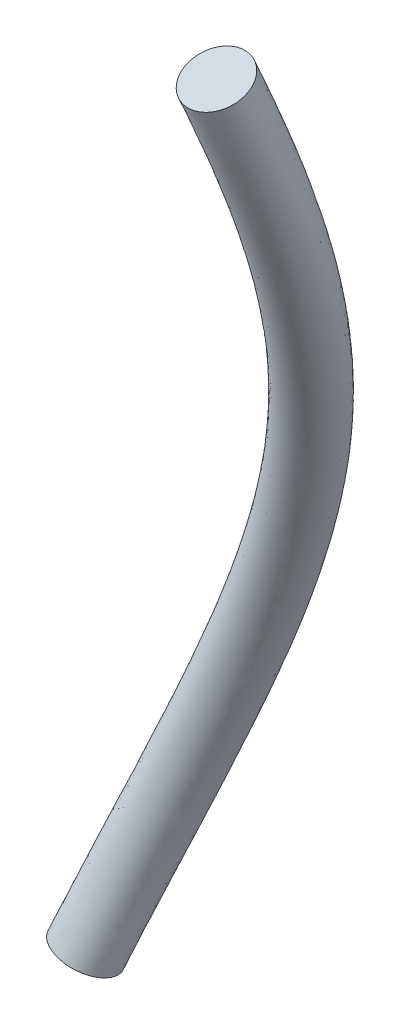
ISO-10303-21;
HEADER;
FILE_DESCRIPTION(('STEP AP214'),'2;1');
FILE_NAME('part.step','',(''),(''),'','','');
FILE_SCHEMA(('AUTOMOTIVE_DESIGN { 1 0 10303 214 1 1 1 1 }'));
ENDSEC;
DATA;
#1=APPLICATION_CONTEXT('core data for automotive mechanical design processes');
#2=APPLICATION_PROTOCOL_DEFINITION('international standard','automotive_design',2000,#1);
#3=PRODUCT_CONTEXT('',#1,'mechanical');
#4=PRODUCT('Part','Part','',(#3));
#5=PRODUCT_RELATED_PRODUCT_CATEGORY('part','',(#4));
#6=PRODUCT_DEFINITION_FORMATION('','',#4);
#7=PRODUCT_DEFINITION_CONTEXT('part definition',#1,'design');
#8=PRODUCT_DEFINITION('design','',#6,#7);
#9=PRODUCT_DEFINITION_SHAPE('','',#8);
#10=(LENGTH_UNIT() NAMED_UNIT(*) SI_UNIT(.MILLI.,.METRE.));
#11=(NAMED_UNIT(*) PLANE_ANGLE_UNIT() SI_UNIT($,.RADIAN.));
#12=(NAMED_UNIT(*) SI_UNIT($,.STERADIAN.) SOLID_ANGLE_UNIT());
#13=UNCERTAINTY_MEASURE_WITH_UNIT(LENGTH_MEASURE(1.E-05),#10,'distance_accuracy_value','');
#14=(GEOMETRIC_REPRESENTATION_CONTEXT(3) GLOBAL_UNCERTAINTY_ASSIGNED_CONTEXT((#13)) GLOBAL_UNIT_ASSIGNED_CONTEXT((#10,
#11,#12)) REPRESENTATION_CONTEXT('',''));
#15=CARTESIAN_POINT('',(0.,0.,0.));
#16=DIRECTION('',(0.,0.,1.));
#17=DIRECTION('',(1.,0.,0.));
#18=AXIS2_PLACEMENT_3D('',#15,#16,#17);
#19=CARTESIAN_POINT('',(-40.1571207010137,0.219399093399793,-20.5564930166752));
#20=DIRECTION('',(-0.273165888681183,-0.922350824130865,0.27322034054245));
#21=DIRECTION('',(0.,-0.284022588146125,-0.958817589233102));
#22=AXIS2_PLACEMENT_3D('',#19,#20,#21);
#23=PLANE('',#22);
#24=CARTESIAN_POINT('',(-39.8338287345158,-0.00818627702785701,-21.0015595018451));
#25=DIRECTION('',(-0.273165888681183,-0.922350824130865,0.273220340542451));
#26=DIRECTION('',(0.543062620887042,-0.382295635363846,-0.747618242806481));
#27=AXIS2_PLACEMENT_3D('',#24,#25,#26);
#28=CIRCLE('',#27,0.595312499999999);
#29=CARTESIAN_POINT('',(-39.510536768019,-0.235771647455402,-21.4466259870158));
#30=VERTEX_POINT('',#29);
#31=EDGE_CURVE('E51',#30,#30,#28,.F.);
#32=ORIENTED_EDGE('',*,*,#31,.F.);
#33=EDGE_LOOP('',(#32));
#34=FACE_BOUND('',#33,.T.);
#35=ADVANCED_FACE('F40',(#34),#23,.T.);
#36=CARTESIAN_POINT('',(-34.4581353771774,19.2706129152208,-18.7725236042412));
#37=DIRECTION('',(0.0604837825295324,-0.922350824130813,-0.381589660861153));
#38=DIRECTION('',(0.,0.382289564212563,-0.924042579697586));
#39=AXIS2_PLACEMENT_3D('',#36,#37,#38);
#40=PLANE('',#39);
#41=CARTESIAN_POINT('',(-34.4581353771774,19.2706129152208,-18.7725236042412));
#42=CARTESIAN_POINT('',(-34.4910381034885,19.2687711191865,-18.7732869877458));
#43=CARTESIAN_POINT('',(-34.5239934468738,19.2658769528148,-18.7715149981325));
#44=CARTESIAN_POINT('',(-34.5894206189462,19.2580126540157,-18.7628765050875));
#45=CARTESIAN_POINT('',(-34.62187940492,19.2530142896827,-18.7559396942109));
#46=CARTESIAN_POINT('',(-34.6849900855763,19.2410726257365,-18.7370785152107));
#47=CARTESIAN_POINT('',(-34.7156396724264,19.2341269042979,-18.7251479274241));
#48=CARTESIAN_POINT('',(-34.7741884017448,19.2184959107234,-18.6966460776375));
#49=CARTESIAN_POINT('',(-34.8020893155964,19.2098117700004,-18.6800778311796));
#50=CARTESIAN_POINT('',(-34.8543751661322,19.1909470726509,-18.6427670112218));
#51=CARTESIAN_POINT('',(-34.8787599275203,19.1807664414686,-18.622024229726));
#52=CARTESIAN_POINT('',(-34.9233177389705,19.1591986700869,-18.5769548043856));
#53=CARTESIAN_POINT('',(-34.9434910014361,19.1478115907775,-18.5526283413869));
#54=CARTESIAN_POINT('',(-34.979055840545,19.1241531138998,-18.5010799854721));
#55=CARTESIAN_POINT('',(-34.9944471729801,19.1118816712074,-18.4738579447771));
#56=CARTESIAN_POINT('',(-35.020009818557,19.0868032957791,-18.4172921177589));
#57=CARTESIAN_POINT('',(-35.0301811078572,19.0739963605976,-18.3879483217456));
#58=CARTESIAN_POINT('',(-35.0450143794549,19.0482114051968,-18.3279739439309));
#59=CARTESIAN_POINT('',(-35.0496766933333,19.0352333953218,-18.2973434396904));
#60=CARTESIAN_POINT('',(-35.0533608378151,19.0094735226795,-18.2356625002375));
#61=CARTESIAN_POINT('',(-35.0523824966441,18.9966916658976,-18.2046120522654));
#62=CARTESIAN_POINT('',(-35.0448127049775,18.9716873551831,-18.1429735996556));
#63=CARTESIAN_POINT('',(-35.0382212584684,18.9594649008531,-18.1123855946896));
#64=CARTESIAN_POINT('',(-35.0196123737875,18.9359263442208,-18.0525403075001));
#65=CARTESIAN_POINT('',(-35.0075949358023,18.9246102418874,-18.0232830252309));
#66=CARTESIAN_POINT('',(-34.9784751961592,18.9032056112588,-17.966929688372));
#67=CARTESIAN_POINT('',(-34.9613728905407,18.8931170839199,-17.9398336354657));
#68=CARTESIAN_POINT('',(-34.9225689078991,18.874453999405,-17.8885719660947));
#69=CARTESIAN_POINT('',(-34.9008672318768,18.8658794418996,-17.8644063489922));
#70=CARTESIAN_POINT('',(-34.8534805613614,18.8504877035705,-17.8196915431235));
#71=CARTESIAN_POINT('',(-34.8277955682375,18.8436705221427,-17.799142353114));
#72=CARTESIAN_POINT('',(-34.7731713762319,18.8319870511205,-17.7622437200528));
#73=CARTESIAN_POINT('',(-34.7442321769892,18.8271207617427,-17.745894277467));
#74=CARTESIAN_POINT('',(-34.6839210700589,18.819477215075,-17.7178592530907));
#75=CARTESIAN_POINT('',(-34.6525491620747,18.8166999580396,-17.7061736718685));
#76=CARTESIAN_POINT('',(-34.588263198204,18.8133133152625,-17.6877980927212));
#77=CARTESIAN_POINT('',(-34.5553491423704,18.8127039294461,-17.681108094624));
#78=CARTESIAN_POINT('',(-34.4889132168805,18.8136703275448,-17.6729135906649));
#79=CARTESIAN_POINT('',(-34.4553913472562,18.8152461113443,-17.6714090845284));
#80=CARTESIAN_POINT('',(-34.3886913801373,18.8205381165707,-17.673628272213));
#81=CARTESIAN_POINT('',(-34.3555132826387,18.8242543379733,-17.6773519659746));
#82=CARTESIAN_POINT('',(-34.2904426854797,18.8337217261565,-17.6899218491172));
#83=CARTESIAN_POINT('',(-34.2585501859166,18.8394728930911,-17.6987680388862));
#84=CARTESIAN_POINT('',(-34.1969561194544,18.8528469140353,-17.7213317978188));
#85=CARTESIAN_POINT('',(-34.1672545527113,18.8604697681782,-17.7350493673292));
#86=CARTESIAN_POINT('',(-34.1108855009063,18.8773707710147,-17.766966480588));
#87=CARTESIAN_POINT('',(-34.0842180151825,18.8866489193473,-17.7851660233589));
#88=CARTESIAN_POINT('',(-34.0346741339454,18.9065971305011,-17.8255304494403));
#89=CARTESIAN_POINT('',(-34.0117977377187,18.9172671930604,-17.8476953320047));
#90=CARTESIAN_POINT('',(-33.9704854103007,18.9396963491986,-17.8953612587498));
#91=CARTESIAN_POINT('',(-33.9520494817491,18.9514554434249,-17.9208623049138));
#92=CARTESIAN_POINT('',(-33.9201414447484,18.9757288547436,-17.9744766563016));
#93=CARTESIAN_POINT('',(-33.9066693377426,18.9882431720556,-18.0025899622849));
#94=CARTESIAN_POINT('',(-33.8850713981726,19.0136717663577,-18.0606307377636));
#95=CARTESIAN_POINT('',(-33.876945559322,19.0265860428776,-18.0905582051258));
#96=CARTESIAN_POINT('',(-33.8662707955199,19.0524479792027,-18.1513777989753));
#97=CARTESIAN_POINT('',(-33.8637218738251,19.0653956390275,-18.1822699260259));
#98=CARTESIAN_POINT('',(-33.8642733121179,19.0909567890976,-18.244141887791));
#99=CARTESIAN_POINT('',(-33.8673736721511,19.1035702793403,-18.2751217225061));
#100=CARTESIAN_POINT('',(-33.8791354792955,19.1281046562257,-18.3362887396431));
#101=CARTESIAN_POINT('',(-33.8877967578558,19.1400255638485,-18.3664759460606));
#102=CARTESIAN_POINT('',(-33.9104350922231,19.1628375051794,-18.4252035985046));
#103=CARTESIAN_POINT('',(-33.9244124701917,19.1737284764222,-18.4537439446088));
#104=CARTESIAN_POINT('',(-33.9572865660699,19.1941708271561,-18.508366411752));
#105=CARTESIAN_POINT('',(-33.9761834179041,19.2037221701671,-18.5344484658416));
#106=CARTESIAN_POINT('',(-34.0183575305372,19.2212127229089,-18.5834101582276));
#107=CARTESIAN_POINT('',(-34.0416342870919,19.2291521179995,-18.6062901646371));
#108=CARTESIAN_POINT('',(-34.0919110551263,19.2431956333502,-18.6482042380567));
#109=CARTESIAN_POINT('',(-34.1189114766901,19.249299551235,-18.6672378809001));
#110=CARTESIAN_POINT('',(-34.1758666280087,19.2594969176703,-18.7009138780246));
#111=CARTESIAN_POINT('',(-34.205821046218,19.2635905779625,-18.7155566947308));
#112=CARTESIAN_POINT('',(-34.267867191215,19.2696568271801,-18.7400542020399));
#113=CARTESIAN_POINT('',(-34.2999616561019,19.2716266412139,-18.7499026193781));
#114=CARTESIAN_POINT('',(-34.365294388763,19.2733749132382,-18.7644839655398));
#115=CARTESIAN_POINT('',(-34.3985295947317,19.2731588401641,-18.7692296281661));
#116=CARTESIAN_POINT('',(-34.440597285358,19.2715200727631,-18.7719364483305));
#117=CARTESIAN_POINT('',(-34.4493644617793,19.271103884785,-18.7723201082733));
#118=CARTESIAN_POINT('',(-34.4581353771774,19.2706129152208,-18.7725236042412));
#119=B_SPLINE_CURVE_WITH_KNOTS('',3,(#41,#42,#43,#44,#45,#46,#47,#48,#49,#50,#51,#52,#53,#54,
#55,#56,#57,#58,#59,#60,#61,#62,#63,#64,#65,#66,#67,#68,#69,#70,#71,#72,#73,#74,#75,#76,#77,#78,
#79,#80,#81,#82,#83,#84,#85,#86,#87,#88,#89,#90,#91,#92,#93,#94,#95,#96,#97,#98,#99,#100,#101,
#102,#103,#104,#105,#106,#107,#108,#109,#110,#111,#112,#113,#114,#115,#116,#117,#118),
.UNSPECIFIED.,.T.,.F.,(4,2,2,2,2,2,2,2,2,2,2,2,2,2,2,2,2,2,2,2,2,2,2,2,2,2,2,2,2,2,2,2,2,2,2,2,
2,2,4),(0.,0.098867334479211,0.199105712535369,0.299469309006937,0.399767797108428,
0.500071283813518,0.600369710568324,0.700673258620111,0.800977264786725,0.901275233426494,
1.00157625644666,1.10187720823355,1.20217815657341,1.30247918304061,1.4027801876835,
1.50308115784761,1.60338213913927,1.70368313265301,1.80398412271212,1.90428510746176,
2.00458609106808,2.10488708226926,2.20518808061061,2.30548905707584,2.40579001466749,
2.50609103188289,2.60639207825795,2.70669300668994,2.8069939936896,2.90729498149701,
3.0075929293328,3.1078969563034,3.20820371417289,3.30849893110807,3.40880520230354,
3.5091009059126,3.60952749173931,3.70970287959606,3.7360580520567),.UNSPECIFIED.);
#120=CARTESIAN_POINT('',(-34.4582645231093,18.8154421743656,-17.6723384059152));
#121=VERTEX_POINT('',#120);
#122=EDGE_CURVE('E11',#121,#121,#119,.F.);
#123=ORIENTED_EDGE('',*,*,#122,.F.);
#124=EDGE_LOOP('',(#123));
#125=FACE_BOUND('',#124,.T.);
#126=ADVANCED_FACE('F42',(#125),#40,.F.);
#127=CARTESIAN_POINT('',(-39.510536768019,-0.235771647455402,-21.4466259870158));
#128=CARTESIAN_POINT('',(-39.3794337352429,0.132026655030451,-21.5392623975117));
#129=CARTESIAN_POINT('',(-39.2399941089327,0.497249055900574,-21.6187991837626));
#130=CARTESIAN_POINT('',(-38.8903224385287,1.41311444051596,-21.8182529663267));
#131=CARTESIAN_POINT('',(-38.5030791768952,2.32897982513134,-21.9282290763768));
#132=CARTESIAN_POINT('',(-38.1158359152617,3.24484520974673,-22.0382051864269));
#133=CARTESIAN_POINT('',(-37.7135262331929,4.16071059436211,-22.0523122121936));
#134=CARTESIAN_POINT('',(-37.311216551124,5.0765759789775,-22.0664192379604));
#135=CARTESIAN_POINT('',(-36.9172212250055,5.99244136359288,-21.9838373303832));
#136=CARTESIAN_POINT('',(-36.523225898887,6.90830674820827,-21.9012554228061));
#137=CARTESIAN_POINT('',(-36.1604425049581,7.82417213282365,-21.7267839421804));
#138=CARTESIAN_POINT('',(-35.7976591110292,8.74003751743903,-21.5523124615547));
#139=CARTESIAN_POINT('',(-35.4871713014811,9.65590290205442,-21.2960910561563));
#140=CARTESIAN_POINT('',(-35.176683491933,10.5717682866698,-21.039869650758));
#141=CARTESIAN_POINT('',(-34.9365356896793,11.4876336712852,-20.7167889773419));
#142=CARTESIAN_POINT('',(-34.6963878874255,12.4034990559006,-20.3937083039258));
#143=CARTESIAN_POINT('',(-34.5405366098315,13.319364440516,-20.0225446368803));
#144=CARTESIAN_POINT('',(-34.3846853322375,14.2352298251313,-19.6513809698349));
#145=CARTESIAN_POINT('',(-34.3221880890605,15.1510952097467,-19.2537049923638));
#146=CARTESIAN_POINT('',(-34.2596908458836,16.0669605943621,-18.8560290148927));
#147=CARTESIAN_POINT('',(-34.2941797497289,16.9828259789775,-18.4549522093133));
#148=CARTESIAN_POINT('',(-34.3286686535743,17.8986913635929,-18.0538754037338));
#149=CARTESIAN_POINT('',(-34.4581393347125,18.8145567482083,-17.6727068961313));
#150=CARTESIAN_POINT('',(-34.4582019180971,18.8149994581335,-17.6725226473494));
#151=CARTESIAN_POINT('',(-34.4582645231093,18.8154421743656,-17.6723384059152));
#152=CARTESIAN_POINT('',(-39.6341841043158,-0.227074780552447,-21.5408893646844));
#153=CARTESIAN_POINT('',(-39.4985168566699,0.140723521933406,-21.6395127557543));
#154=CARTESIAN_POINT('',(-39.3539559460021,0.505945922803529,-21.7245675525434));
#155=CARTESIAN_POINT('',(-38.9914416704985,1.42181130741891,-21.9378588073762));
#156=CARTESIAN_POINT('',(-38.5884174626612,2.3376766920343,-22.0581968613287));
#157=CARTESIAN_POINT('',(-38.1853932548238,3.25354207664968,-22.1785349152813));
#158=CARTESIAN_POINT('',(-37.7652814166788,4.16940746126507,-22.198926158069));
#159=CARTESIAN_POINT('',(-37.3451695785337,5.08527284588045,-22.2193174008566));
#160=CARTESIAN_POINT('',(-36.9323854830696,6.00113823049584,-22.1385767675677));
#161=CARTESIAN_POINT('',(-36.5196013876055,6.91700361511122,-22.0578361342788));
#162=CARTESIAN_POINT('',(-36.1381345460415,7.8328689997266,-21.8806559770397));
#163=CARTESIAN_POINT('',(-35.7566677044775,8.74873438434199,-21.7034758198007));
#164=CARTESIAN_POINT('',(-35.4286875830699,9.66459976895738,-21.4401532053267));
#165=CARTESIAN_POINT('',(-35.1007074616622,10.5804651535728,-21.1768305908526));
#166=CARTESIAN_POINT('',(-34.8452750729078,11.4963305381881,-20.8426688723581));
#167=CARTESIAN_POINT('',(-34.5898426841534,12.4121959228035,-20.5085071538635));
#168=CARTESIAN_POINT('',(-34.4218028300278,13.3280613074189,-20.1229265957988));
#169=CARTESIAN_POINT('',(-34.2537629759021,14.2439266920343,-19.7373460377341));
#170=CARTESIAN_POINT('',(-34.182881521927,15.1597920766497,-19.3227551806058));
#171=CARTESIAN_POINT('',(-34.1120000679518,16.0756574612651,-18.9081643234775));
#172=CARTESIAN_POINT('',(-34.1423963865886,16.9915228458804,-18.4886576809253));
#173=CARTESIAN_POINT('',(-34.1727927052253,17.9073882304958,-18.0691510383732));
#174=CARTESIAN_POINT('',(-34.302700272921,18.8232536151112,-17.6691088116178));
#175=CARTESIAN_POINT('',(-34.3027630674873,18.8236963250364,-17.6689154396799));
#176=CARTESIAN_POINT('',(-34.3028258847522,18.8241390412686,-17.6687220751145));
#177=CARTESIAN_POINT('',(-40.0318715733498,-0.168279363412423,-21.7400130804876));
#178=CARTESIAN_POINT('',(-39.8865627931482,0.19951893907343,-21.8578924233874));
#179=CARTESIAN_POINT('',(-39.7305450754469,0.564741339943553,-21.9611815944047));
#180=CARTESIAN_POINT('',(-39.3393006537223,1.48060672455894,-22.2201990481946));
#181=CARTESIAN_POINT('',(-38.8974381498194,2.39647210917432,-22.3780590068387));
#182=CARTESIAN_POINT('',(-38.4555756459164,3.31233749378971,-22.5359189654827));
#183=CARTESIAN_POINT('',(-37.9887745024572,4.22820287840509,-22.583447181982));
#184=CARTESIAN_POINT('',(-37.521973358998,5.14406826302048,-22.6309753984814));
#185=CARTESIAN_POINT('',(-37.0573623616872,6.05993364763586,-22.5654097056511));
#186=CARTESIAN_POINT('',(-36.5927513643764,6.97579903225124,-22.4998440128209));
#187=CARTESIAN_POINT('',(-36.1573320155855,7.89166441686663,-22.3249948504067));
#188=CARTESIAN_POINT('',(-35.7219126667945,8.80752980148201,-22.1501456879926));
#189=CARTESIAN_POINT('',(-35.3409899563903,9.7233951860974,-21.8761746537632));
#190=CARTESIAN_POINT('',(-34.960067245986,10.6392605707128,-21.6022036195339));
#191=CARTESIAN_POINT('',(-34.6557790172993,11.5551259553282,-21.2450329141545));
#192=CARTESIAN_POINT('',(-34.3514907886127,12.4709913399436,-20.8878622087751));
#193=CARTESIAN_POINT('',(-34.1415211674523,13.3868567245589,-20.4682492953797));
#194=CARTESIAN_POINT('',(-33.9315515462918,14.3027221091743,-20.0486363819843));
#195=CARTESIAN_POINT('',(-33.8281032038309,15.2185874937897,-19.5909676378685));
#196=CARTESIAN_POINT('',(-33.72465486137,16.1344528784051,-19.1332988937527));
#197=CARTESIAN_POINT('',(-33.733739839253,17.0503182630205,-18.6641723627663));
#198=CARTESIAN_POINT('',(-33.7428248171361,17.9661836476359,-18.1950458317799));
#199=CARTESIAN_POINT('',(-33.863915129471,18.8820490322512,-17.7417254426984));
#200=CARTESIAN_POINT('',(-33.8639736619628,18.8824917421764,-17.7415063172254));
#201=CARTESIAN_POINT('',(-33.8640322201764,18.8829344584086,-17.7412871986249));
#202=CARTESIAN_POINT('',(-40.581162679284,0.218400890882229,-20.9838202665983));
#203=CARTESIAN_POINT('',(-40.4724686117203,0.586199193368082,-21.1282961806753));
#204=CARTESIAN_POINT('',(-40.3503247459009,0.951421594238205,-21.261594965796));
#205=CARTESIAN_POINT('',(-40.0440255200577,1.86728697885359,-21.5958672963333));
#206=CARTESIAN_POINT('',(-39.6666301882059,2.78315236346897,-21.8471240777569));
#207=CARTESIAN_POINT('',(-39.289234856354,3.69901774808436,-22.0983808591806));
#208=CARTESIAN_POINT('',(-38.8626762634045,4.61488313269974,-22.2520199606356));
#209=CARTESIAN_POINT('',(-38.436117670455,5.53074851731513,-22.4056590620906));
#210=CARTESIAN_POINT('',(-37.9851858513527,6.44661390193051,-22.4527515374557));
#211=CARTESIAN_POINT('',(-37.5342540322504,7.3624792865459,-22.4998440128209));
#212=CARTESIAN_POINT('',(-37.085155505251,8.27834467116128,-22.4376530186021));
#213=CARTESIAN_POINT('',(-36.6360569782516,9.19421005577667,-22.3754620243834));
#214=CARTESIAN_POINT('',(-36.2148917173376,10.110075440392,-22.2076018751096));
#215=CARTESIAN_POINT('',(-35.7937264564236,11.0259408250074,-22.0397417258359));
#216=CARTESIAN_POINT('',(-35.4249710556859,11.9418062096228,-21.7759678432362));
#217=CARTESIAN_POINT('',(-35.0562156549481,12.8576715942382,-21.5121939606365));
#218=CARTESIAN_POINT('',(-34.7613008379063,13.7735369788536,-21.1678359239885));
#219=CARTESIAN_POINT('',(-34.4663860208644,14.689402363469,-20.8234778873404));
#220=CARTESIAN_POINT('',(-34.262451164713,15.6052677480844,-20.4185485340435));
#221=CARTESIAN_POINT('',(-34.0585163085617,16.5211331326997,-20.0136191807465));
#222=CARTESIAN_POINT('',(-33.9574133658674,17.4369985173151,-19.571651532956));
#223=CARTESIAN_POINT('',(-33.8563104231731,18.3528639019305,-19.1296838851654));
#224=CARTESIAN_POINT('',(-33.863915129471,19.2687292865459,-18.6763634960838));
#225=CARTESIAN_POINT('',(-33.8639188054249,19.2691719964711,-18.6761443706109));
#226=CARTESIAN_POINT('',(-33.863922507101,19.2696147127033,-18.675925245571));
#227=CARTESIAN_POINT('',(-40.2807680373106,0.228095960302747,-20.6507563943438));
#228=CARTESIAN_POINT('',(-40.1882008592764,0.595894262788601,-20.7806872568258));
#229=CARTESIAN_POINT('',(-40.0835136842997,0.961116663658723,-20.9010671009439));
#230=CARTESIAN_POINT('',(-39.8209904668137,1.87698204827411,-21.2029427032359));
#231=CARTESIAN_POINT('',(-39.4938521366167,2.79284743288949,-21.4332204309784));
#232=CARTESIAN_POINT('',(-39.1667138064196,3.70871281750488,-21.6634981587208));
#233=CARTESIAN_POINT('',(-38.793972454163,4.62457820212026,-21.8087951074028));
#234=CARTESIAN_POINT('',(-38.4212311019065,5.54044358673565,-21.9540920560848));
#235=CARTESIAN_POINT('',(-38.0245491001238,6.45630897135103,-22.0059640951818));
#236=CARTESIAN_POINT('',(-37.6278670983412,7.37217435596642,-22.0578361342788));
#237=CARTESIAN_POINT('',(-37.2302981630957,8.2880397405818,-22.0132686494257));
#238=CARTESIAN_POINT('',(-36.8327292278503,9.20390512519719,-21.9687011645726));
#239=CARTESIAN_POINT('',(-36.4573786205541,10.1197705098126,-21.8302842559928));
#240=CARTESIAN_POINT('',(-36.082028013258,11.035635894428,-21.6918673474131));
#241=CARTESIAN_POINT('',(-35.7507097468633,11.9515012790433,-21.4676453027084));
#242=CARTESIAN_POINT('',(-35.4193914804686,12.8673666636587,-21.2434232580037));
#243=CARTESIAN_POINT('',(-35.1513605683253,13.7832320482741,-20.9464270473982));
#244=CARTESIAN_POINT('',(-34.883329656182,14.6990974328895,-20.6494308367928));
#245=CARTESIAN_POINT('',(-34.6941630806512,15.6149628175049,-20.2969208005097));
#246=CARTESIAN_POINT('',(-34.5049965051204,16.5308282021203,-19.9444107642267));
#247=CARTESIAN_POINT('',(-34.4056879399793,17.4466935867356,-19.5568735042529));
#248=CARTESIAN_POINT('',(-34.3063793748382,18.362558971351,-19.1693362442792));
#249=CARTESIAN_POINT('',(-34.302700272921,19.2784243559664,-18.7692940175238));
#250=CARTESIAN_POINT('',(-34.3026984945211,19.2788670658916,-18.7691006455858));
#251=CARTESIAN_POINT('',(-34.3026967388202,19.2793097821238,-18.7689072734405));
#252=CARTESIAN_POINT('',(-40.0334733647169,0.210702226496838,-20.4622296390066));
#253=CARTESIAN_POINT('',(-39.9500346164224,0.578500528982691,-20.5801865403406));
#254=CARTESIAN_POINT('',(-39.8555900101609,0.943722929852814,-20.6895303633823));
#255=CARTESIAN_POINT('',(-39.618752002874,1.8595883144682,-20.9637310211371));
#256=CARTESIAN_POINT('',(-39.3231755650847,2.77545369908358,-21.1732848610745));
#257=CARTESIAN_POINT('',(-39.0275991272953,3.69131908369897,-21.382838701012));
#258=CARTESIAN_POINT('',(-38.6904620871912,4.60718446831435,-21.5155672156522));
#259=CARTESIAN_POINT('',(-38.3533250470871,5.52304985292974,-21.6482957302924));
#260=CARTESIAN_POINT('',(-37.9942205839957,6.43891523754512,-21.6964852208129));
#261=CARTESIAN_POINT('',(-37.6351161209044,7.35478062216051,-21.7446747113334));
#262=CARTESIAN_POINT('',(-37.274914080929,8.27064600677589,-21.7055245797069));
#263=CARTESIAN_POINT('',(-36.9147120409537,9.18651139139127,-21.6663744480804));
#264=CARTESIAN_POINT('',(-36.5743460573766,10.1023767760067,-21.5421599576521));
#265=CARTESIAN_POINT('',(-36.2339800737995,11.018242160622,-21.4179454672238));
#266=CARTESIAN_POINT('',(-35.9332309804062,11.9341075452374,-21.215885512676));
#267=CARTESIAN_POINT('',(-35.6324818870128,12.8499729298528,-21.0138255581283));
#268=CARTESIAN_POINT('',(-35.3888281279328,13.7658383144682,-20.7456631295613));
#269=CARTESIAN_POINT('',(-35.1451743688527,14.6817036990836,-20.4775007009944));
#270=CARTESIAN_POINT('',(-34.9727762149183,15.597569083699,-20.1588204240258));
#271=CARTESIAN_POINT('',(-34.8003780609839,16.5134344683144,-19.8401401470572));
#272=CARTESIAN_POINT('',(-34.70925466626,17.4292998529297,-19.4894625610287));
#273=CARTESIAN_POINT('',(-34.6181312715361,18.3451652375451,-19.1387849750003));
#274=CARTESIAN_POINT('',(-34.613578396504,19.2610306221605,-18.7764901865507));
#275=CARTESIAN_POINT('',(-34.6135761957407,19.2614733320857,-18.7763150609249));
#276=CARTESIAN_POINT('',(-34.6135740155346,19.2619160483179,-18.7761399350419));
#277=CARTESIAN_POINT('',(-39.6357858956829,0.15190680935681,-20.2631059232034));
#278=CARTESIAN_POINT('',(-39.5619886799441,0.519705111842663,-20.3618068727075));
#279=CARTESIAN_POINT('',(-39.4790008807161,0.884927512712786,-20.4529163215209));
#280=CARTESIAN_POINT('',(-39.2708930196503,1.80079289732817,-20.6813907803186));
#281=CARTESIAN_POINT('',(-39.0141548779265,2.71665828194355,-20.8534227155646));
#282=CARTESIAN_POINT('',(-38.7574167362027,3.63252366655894,-21.0254546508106));
#283=CARTESIAN_POINT('',(-38.4669690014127,4.54838905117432,-21.1310461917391));
#284=CARTESIAN_POINT('',(-38.1765212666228,5.46425443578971,-21.2366377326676));
#285=CARTESIAN_POINT('',(-37.8692437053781,6.38011982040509,-21.2696522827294));
#286=CARTESIAN_POINT('',(-37.5619661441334,7.29598520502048,-21.3026668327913));
#287=CARTESIAN_POINT('',(-37.255716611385,8.21185058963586,-21.2611857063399));
#288=CARTESIAN_POINT('',(-36.9494670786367,9.12771597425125,-21.2197045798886));
#289=CARTESIAN_POINT('',(-36.6620436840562,10.0435813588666,-21.1061385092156));
#290=CARTESIAN_POINT('',(-36.3746202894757,10.959446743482,-20.9925724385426));
#291=CARTESIAN_POINT('',(-36.1227270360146,11.8753121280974,-20.8135214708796));
#292=CARTESIAN_POINT('',(-35.8708337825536,12.7911775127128,-20.6344705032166));
#293=CARTESIAN_POINT('',(-35.6691097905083,13.7070428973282,-20.4003404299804));
#294=CARTESIAN_POINT('',(-35.467385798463,14.6229082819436,-20.1662103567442));
#295=CARTESIAN_POINT('',(-35.3275545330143,15.5387736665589,-19.8906079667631));
#296=CARTESIAN_POINT('',(-35.1877232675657,16.4546390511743,-19.615005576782));
#297=CARTESIAN_POINT('',(-35.1179112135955,17.3705044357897,-19.3139478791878));
#298=CARTESIAN_POINT('',(-35.0480991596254,18.2863698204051,-19.0128901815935));
#299=CARTESIAN_POINT('',(-35.052363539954,19.2022352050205,-18.7038735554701));
#300=CARTESIAN_POINT('',(-35.0523656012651,19.2026779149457,-18.7037241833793));
#301=CARTESIAN_POINT('',(-35.0523676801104,19.2031206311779,-18.7035748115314));
#302=CARTESIAN_POINT('',(-39.0864947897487,-0.234773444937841,-21.0192987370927));
#303=CARTESIAN_POINT('',(-38.976082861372,0.133024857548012,-21.0914031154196));
#304=CARTESIAN_POINT('',(-38.8592212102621,0.498247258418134,-21.1525029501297));
#305=CARTESIAN_POINT('',(-38.5661681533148,1.41411264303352,-21.30572253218));
#306=CARTESIAN_POINT('',(-38.24496283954,2.3299780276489,-21.3843576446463));
#307=CARTESIAN_POINT('',(-37.9237575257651,3.24584341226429,-21.4629927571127));
#308=CARTESIAN_POINT('',(-37.5930672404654,4.16170879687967,-21.4624734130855));
#309=CARTESIAN_POINT('',(-37.2623769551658,5.07757418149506,-21.4619540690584));
#310=CARTESIAN_POINT('',(-36.9414202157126,5.99343956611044,-21.3823104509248));
#311=CARTESIAN_POINT('',(-36.6204634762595,6.90930495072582,-21.3026668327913));
#312=CARTESIAN_POINT('',(-36.3278931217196,7.82517033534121,-21.1485275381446));
#313=CARTESIAN_POINT('',(-36.0353227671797,8.7410357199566,-20.9943882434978));
#314=CARTESIAN_POINT('',(-35.7881419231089,9.65690110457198,-20.7747112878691));
#315=CARTESIAN_POINT('',(-35.5409610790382,10.5727664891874,-20.5550343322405));
#316=CARTESIAN_POINT('',(-35.3535349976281,11.4886318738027,-20.2825865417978));
#317=CARTESIAN_POINT('',(-35.1661089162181,12.4044972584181,-20.0101387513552));
#318=CARTESIAN_POINT('',(-35.0493301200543,13.3203626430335,-19.7007538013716));
#319=CARTESIAN_POINT('',(-34.9325513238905,14.2362280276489,-19.3913688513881));
#320=CARTESIAN_POINT('',(-34.8932065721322,15.1520934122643,-19.0630270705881));
#321=CARTESIAN_POINT('',(-34.853861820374,16.0679587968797,-18.7346852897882));
#322=CARTESIAN_POINT('',(-34.8942376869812,16.9838241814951,-18.4064687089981));
#323=CARTESIAN_POINT('',(-34.9346135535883,17.8996895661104,-18.0782521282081));
#324=CARTESIAN_POINT('',(-35.052363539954,18.8155549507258,-17.7692355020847));
#325=CARTESIAN_POINT('',(-35.052420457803,18.815997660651,-17.7690861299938));
#326=CARTESIAN_POINT('',(-35.0524773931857,18.8164403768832,-17.7689367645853));
#327=CARTESIAN_POINT('',(-39.3868894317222,-0.244468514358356,-21.3523626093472));
#328=CARTESIAN_POINT('',(-39.2603506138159,0.123329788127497,-21.4390120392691));
#329=CARTESIAN_POINT('',(-39.1260322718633,0.488552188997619,-21.5130308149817));
#330=CARTESIAN_POINT('',(-38.7892032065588,1.404417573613,-21.6986471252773));
#331=CARTESIAN_POINT('',(-38.4177408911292,2.32028295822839,-21.7982612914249));
#332=CARTESIAN_POINT('',(-38.0462785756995,3.23614834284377,-21.8978754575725));
#333=CARTESIAN_POINT('',(-37.6617710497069,4.15201372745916,-21.9056982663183));
#334=CARTESIAN_POINT('',(-37.2772635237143,5.06787911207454,-21.9135210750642));
#335=CARTESIAN_POINT('',(-36.9020569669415,5.98374449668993,-21.8290978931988));
#336=CARTESIAN_POINT('',(-36.5268504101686,6.89960988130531,-21.7446747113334));
#337=CARTESIAN_POINT('',(-36.1827504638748,7.8154752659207,-21.572911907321));
#338=CARTESIAN_POINT('',(-35.838650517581,8.73134065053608,-21.4011491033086));
#339=CARTESIAN_POINT('',(-35.5456550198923,9.64720603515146,-21.152028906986));
#340=CARTESIAN_POINT('',(-35.2526595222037,10.5630714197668,-20.9029087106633));
#341=CARTESIAN_POINT('',(-35.0277963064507,11.4789368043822,-20.5909090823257));
#342=CARTESIAN_POINT('',(-34.8029330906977,12.3948021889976,-20.278909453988));
#343=CARTESIAN_POINT('',(-34.6592703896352,13.310667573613,-19.9221626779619));
#344=CARTESIAN_POINT('',(-34.5156076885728,14.2265329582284,-19.5654159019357));
#345=CARTESIAN_POINT('',(-34.4614946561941,15.1423983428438,-19.1846548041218));
#346=CARTESIAN_POINT('',(-34.4073816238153,16.0582637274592,-18.803893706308));
#347=CARTESIAN_POINT('',(-34.4459631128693,16.9741291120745,-18.4212467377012));
#348=CARTESIAN_POINT('',(-34.4845446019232,17.8899944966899,-18.0385997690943));
#349=CARTESIAN_POINT('',(-34.613578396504,18.8058598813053,-17.6763049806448));
#350=CARTESIAN_POINT('',(-34.6136407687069,18.8063025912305,-17.6761298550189));
#351=CARTESIAN_POINT('',(-34.6137031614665,18.8067453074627,-17.6759547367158));
#352=CARTESIAN_POINT('',(-39.510536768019,-0.235771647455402,-21.4466259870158));
#353=CARTESIAN_POINT('',(-39.3794337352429,0.132026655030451,-21.5392623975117));
#354=CARTESIAN_POINT('',(-39.2399941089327,0.497249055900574,-21.6187991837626));
#355=CARTESIAN_POINT('',(-38.8903224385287,1.41311444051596,-21.8182529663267));
#356=CARTESIAN_POINT('',(-38.5030791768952,2.32897982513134,-21.9282290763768));
#357=CARTESIAN_POINT('',(-38.1158359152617,3.24484520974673,-22.0382051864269));
#358=CARTESIAN_POINT('',(-37.7135262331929,4.16071059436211,-22.0523122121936));
#359=CARTESIAN_POINT('',(-37.311216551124,5.0765759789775,-22.0664192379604));
#360=CARTESIAN_POINT('',(-36.9172212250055,5.99244136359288,-21.9838373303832));
#361=CARTESIAN_POINT('',(-36.523225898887,6.90830674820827,-21.9012554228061));
#362=CARTESIAN_POINT('',(-36.1604425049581,7.82417213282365,-21.7267839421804));
#363=CARTESIAN_POINT('',(-35.7976591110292,8.74003751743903,-21.5523124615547));
#364=CARTESIAN_POINT('',(-35.4871713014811,9.65590290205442,-21.2960910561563));
#365=CARTESIAN_POINT('',(-35.176683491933,10.5717682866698,-21.039869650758));
#366=CARTESIAN_POINT('',(-34.9365356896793,11.4876336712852,-20.7167889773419));
#367=CARTESIAN_POINT('',(-34.6963878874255,12.4034990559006,-20.3937083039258));
#368=CARTESIAN_POINT('',(-34.5405366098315,13.319364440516,-20.0225446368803));
#369=CARTESIAN_POINT('',(-34.3846853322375,14.2352298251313,-19.6513809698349));
#370=CARTESIAN_POINT('',(-34.3221880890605,15.1510952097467,-19.2537049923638));
#371=CARTESIAN_POINT('',(-34.2596908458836,16.0669605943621,-18.8560290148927));
#372=CARTESIAN_POINT('',(-34.2941797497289,16.9828259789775,-18.4549522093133));
#373=CARTESIAN_POINT('',(-34.3286686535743,17.8986913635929,-18.0538754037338));
#374=CARTESIAN_POINT('',(-34.4581393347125,18.8145567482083,-17.6727068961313));
#375=CARTESIAN_POINT('',(-34.4582019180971,18.8149994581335,-17.6725226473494));
#376=CARTESIAN_POINT('',(-34.4582645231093,18.8154421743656,-17.6723384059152));
#377=(BOUNDED_SURFACE() B_SPLINE_SURFACE(3,2,((#127,#128,#129,#130,#131,#132,#133,#134,#135,
#136,#137,#138,#139,#140,#141,#142,#143,#144,#145,#146,#147,#148,#149,#150,#151),(#152,#153,
#154,#155,#156,#157,#158,#159,#160,#161,#162,#163,#164,#165,#166,#167,#168,#169,#170,#171,#172,
#173,#174,#175,#176),(#177,#178,#179,#180,#181,#182,#183,#184,#185,#186,#187,#188,#189,#190,
#191,#192,#193,#194,#195,#196,#197,#198,#199,#200,#201),(#202,#203,#204,#205,#206,#207,#208,
#209,#210,#211,#212,#213,#214,#215,#216,#217,#218,#219,#220,#221,#222,#223,#224,#225,#226),
(#227,#228,#229,#230,#231,#232,#233,#234,#235,#236,#237,#238,#239,#240,#241,#242,#243,#244,#245,
#246,#247,#248,#249,#250,#251),(#252,#253,#254,#255,#256,#257,#258,#259,#260,#261,#262,#263,
#264,#265,#266,#267,#268,#269,#270,#271,#272,#273,#274,#275,#276),(#277,#278,#279,#280,#281,
#282,#283,#284,#285,#286,#287,#288,#289,#290,#291,#292,#293,#294,#295,#296,#297,#298,#299,#300,
#301),(#302,#303,#304,#305,#306,#307,#308,#309,#310,#311,#312,#313,#314,#315,#316,#317,#318,
#319,#320,#321,#322,#323,#324,#325,#326),(#327,#328,#329,#330,#331,#332,#333,#334,#335,#336,
#337,#338,#339,#340,#341,#342,#343,#344,#345,#346,#347,#348,#349,#350,#351),(#352,#353,#354,
#355,#356,#357,#358,#359,#360,#361,#362,#363,#364,#365,#366,#367,#368,#369,#370,#371,#372,#373,
#374,#375,#376)),.UNSPECIFIED.,.T.,.F.,.F.) B_SPLINE_SURFACE_WITH_KNOTS((4,2,2,2,4),(3,2,2,2,2,
2,2,2,2,2,2,2,3),(0.,0.25,0.5,0.75,1.),(0.0571239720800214,0.0714285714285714,0.107142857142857,
0.142857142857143,0.178571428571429,0.214285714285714,0.25,0.285714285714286,0.321428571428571,
0.357142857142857,0.392857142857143,0.428571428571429,0.428588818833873),
.UNSPECIFIED.) GEOMETRIC_REPRESENTATION_ITEM() RATIONAL_B_SPLINE_SURFACE(((0.996498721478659,
0.997079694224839,1.,0.992708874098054,1.,0.992708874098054,1.,0.992708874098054,1.,
0.992708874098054,1.,0.992708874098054,1.,0.992708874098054,1.,0.992708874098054,1.,
0.992708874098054,1.,0.992708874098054,1.,0.992708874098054,1.,0.999996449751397,
0.999992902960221),(0.996498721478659,0.997079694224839,1.,0.992708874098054,1.,
0.992708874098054,1.,0.992708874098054,1.,0.992708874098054,1.,0.992708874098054,1.,
0.992708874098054,1.,0.992708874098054,1.,0.992708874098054,1.,0.992708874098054,1.,
0.992708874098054,1.,0.999996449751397,0.999992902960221),(0.679722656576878,0.680118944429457,
0.68211091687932,0.677137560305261,0.68211091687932,0.677137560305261,0.68211091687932,
0.677137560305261,0.68211091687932,0.677137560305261,0.68211091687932,0.677137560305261,
0.68211091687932,0.677137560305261,0.68211091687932,0.677137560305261,0.68211091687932,
0.677137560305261,0.68211091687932,0.677137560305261,0.68211091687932,0.677137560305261,
0.68211091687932,0.68210849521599,0.682106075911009),(0.679722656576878,0.680118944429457,
0.68211091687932,0.677137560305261,0.68211091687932,0.677137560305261,0.68211091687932,
0.677137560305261,0.68211091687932,0.677137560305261,0.68211091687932,0.677137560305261,
0.68211091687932,0.677137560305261,0.68211091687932,0.677137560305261,0.68211091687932,
0.677137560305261,0.68211091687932,0.677137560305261,0.68211091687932,0.677137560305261,
0.68211091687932,0.68210849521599,0.682106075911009),(0.996498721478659,0.997079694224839,1.,
0.992708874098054,1.,0.992708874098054,1.,0.992708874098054,1.,0.992708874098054,1.,
0.992708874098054,1.,0.992708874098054,1.,0.992708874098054,1.,0.992708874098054,1.,
0.992708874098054,1.,0.992708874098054,1.,0.999996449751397,0.999992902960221),
(0.996498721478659,0.997079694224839,1.,0.992708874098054,1.,0.992708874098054,1.,
0.992708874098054,1.,0.992708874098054,1.,0.992708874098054,1.,0.992708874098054,1.,
0.992708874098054,1.,0.992708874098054,1.,0.992708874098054,1.,0.992708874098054,1.,
0.999996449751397,0.999992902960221),(0.679722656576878,0.680118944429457,0.68211091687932,
0.677137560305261,0.68211091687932,0.677137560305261,0.68211091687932,0.677137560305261,
0.68211091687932,0.677137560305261,0.68211091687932,0.677137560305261,0.68211091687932,
0.677137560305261,0.68211091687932,0.677137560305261,0.68211091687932,0.677137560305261,
0.68211091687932,0.677137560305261,0.68211091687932,0.677137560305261,0.68211091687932,
0.68210849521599,0.682106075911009),(0.679722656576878,0.680118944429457,0.68211091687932,
0.677137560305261,0.68211091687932,0.677137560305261,0.68211091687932,0.677137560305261,
0.68211091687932,0.677137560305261,0.68211091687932,0.677137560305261,0.68211091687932,
0.677137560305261,0.68211091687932,0.677137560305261,0.68211091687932,0.677137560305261,
0.68211091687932,0.677137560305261,0.68211091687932,0.677137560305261,0.68211091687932,
0.68210849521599,0.682106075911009),(0.996498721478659,0.997079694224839,1.,0.992708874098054,
1.,0.992708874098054,1.,0.992708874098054,1.,0.992708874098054,1.,0.992708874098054,1.,
0.992708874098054,1.,0.992708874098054,1.,0.992708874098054,1.,0.992708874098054,1.,
0.992708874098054,1.,0.999996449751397,0.999992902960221),(0.996498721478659,0.997079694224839,
1.,0.992708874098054,1.,0.992708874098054,1.,0.992708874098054,1.,0.992708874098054,1.,
0.992708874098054,1.,0.992708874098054,1.,0.992708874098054,1.,0.992708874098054,1.,
0.992708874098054,1.,0.992708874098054,1.,0.999996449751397,0.999992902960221))) REPRESENTATION_ITEM('') SURFACE());
#378=CARTESIAN_POINT('',(-39.510536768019,-0.235771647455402,-21.4466259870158));
#379=CARTESIAN_POINT('',(-39.5061016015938,-0.223329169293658,-21.4497598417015));
#380=CARTESIAN_POINT('',(-39.5016585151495,-0.210886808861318,-21.4528829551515));
#381=CARTESIAN_POINT('',(-39.4927573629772,-0.186004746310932,-21.4591070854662));
#382=CARTESIAN_POINT('',(-39.48829930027,-0.173565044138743,-21.4622081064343));
#383=CARTESIAN_POINT('',(-39.4793683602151,-0.148688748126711,-21.4683879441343));
#384=CARTESIAN_POINT('',(-39.4748954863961,-0.136252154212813,-21.4714667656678));
#385=CARTESIAN_POINT('',(-39.4659350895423,-0.111382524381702,-21.4776020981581));
#386=CARTESIAN_POINT('',(-39.461447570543,-0.0989494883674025,-21.4806586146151));
#387=CARTESIAN_POINT('',(-39.4524580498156,-0.0740874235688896,-21.4867492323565));
#388=CARTESIAN_POINT('',(-39.4479560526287,-0.0616583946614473,-21.4897833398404));
#389=CARTESIAN_POINT('',(-39.4389377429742,-0.0368047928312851,-21.4958290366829));
#390=CARTESIAN_POINT('',(-39.4344214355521,-0.0243802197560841,-21.4988406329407));
#391=CARTESIAN_POINT('',(-39.4253746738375,0.000464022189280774,-21.5048412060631));
#392=CARTESIAN_POINT('',(-39.4208442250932,0.0128836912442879,-21.5078301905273));
#393=CARTESIAN_POINT('',(-39.4117693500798,0.0377176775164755,-21.5137854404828));
#394=CARTESIAN_POINT('',(-39.4072249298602,0.0501319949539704,-21.5167517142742));
#395=CARTESIAN_POINT('',(-39.3981222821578,0.0749548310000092,-21.522661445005));
#396=CARTESIAN_POINT('',(-39.3935640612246,0.0873633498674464,-21.5256049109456));
#397=CARTESIAN_POINT('',(-39.3844339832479,0.11217414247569,-21.5314689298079));
#398=CARTESIAN_POINT('',(-39.3798621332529,0.124576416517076,-21.5343894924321));
#399=CARTESIAN_POINT('',(-39.3707049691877,0.149374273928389,-21.5402076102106));
#400=CARTESIAN_POINT('',(-39.3661196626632,0.161769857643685,-21.5431051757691));
#401=CARTESIAN_POINT('',(-39.3569357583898,0.186553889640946,-21.5488772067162));
#402=CARTESIAN_POINT('',(-39.3523371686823,0.198942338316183,-21.5517516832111));
#403=CARTESIAN_POINT('',(-39.3431268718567,0.223711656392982,-21.557477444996));
#404=CARTESIAN_POINT('',(-39.3385151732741,0.236092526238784,-21.5603287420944));
#405=CARTESIAN_POINT('',(-39.3292788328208,0.260846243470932,-21.5660080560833));
#406=CARTESIAN_POINT('',(-39.3246541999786,0.27321909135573,-21.5688360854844));
#407=CARTESIAN_POINT('',(-39.3153921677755,0.297956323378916,-21.5744687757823));
#408=CARTESIAN_POINT('',(-39.3107547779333,0.31032070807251,-21.5772734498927));
#409=CARTESIAN_POINT('',(-39.3014674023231,0.33504056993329,-21.5828593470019));
#410=CARTESIAN_POINT('',(-39.2968174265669,0.347396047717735,-21.5856405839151));
#411=CARTESIAN_POINT('',(-39.2875050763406,0.372097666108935,-21.5911795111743));
#412=CARTESIAN_POINT('',(-39.2828427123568,0.384443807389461,-21.5939372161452));
#413=CARTESIAN_POINT('',(-39.2735056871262,0.409126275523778,-21.5994290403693));
#414=CARTESIAN_POINT('',(-39.2688310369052,0.421462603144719,-21.6021631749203));
#415=CARTESIAN_POINT('',(-39.259469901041,0.446125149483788,-21.6076076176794));
#416=CARTESIAN_POINT('',(-39.2547834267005,0.458451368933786,-21.6103179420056));
#417=CARTESIAN_POINT('',(-39.2453974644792,0.483093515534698,-21.6157154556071));
#418=CARTESIAN_POINT('',(-39.2406979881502,0.495409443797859,-21.6184026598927));
#419=CARTESIAN_POINT('',(-39.2312860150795,0.520046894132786,-21.6237539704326));
#420=CARTESIAN_POINT('',(-39.22657351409,0.532368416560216,-21.6264180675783));
#421=CARTESIAN_POINT('',(-39.2171343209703,0.557021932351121,-21.6317238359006));
#422=CARTESIAN_POINT('',(-39.2124076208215,0.569353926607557,-21.6343654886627));
#423=CARTESIAN_POINT('',(-39.2029400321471,0.594027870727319,-21.6396263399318));
#424=CARTESIAN_POINT('',(-39.1981991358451,0.606369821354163,-21.6422455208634));
#425=CARTESIAN_POINT('',(-39.188703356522,0.631063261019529,-21.6474612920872));
#426=CARTESIAN_POINT('',(-39.1839484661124,0.643414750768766,-21.6500578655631));
#427=CARTESIAN_POINT('',(-39.1744248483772,0.668126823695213,-21.6552283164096));
#428=CARTESIAN_POINT('',(-39.1696561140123,0.680487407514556,-21.6578021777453));
#429=CARTESIAN_POINT('',(-39.1601049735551,0.705217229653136,-21.6629270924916));
#430=CARTESIAN_POINT('',(-39.1553225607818,0.717586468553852,-21.6654781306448));
#431=CARTESIAN_POINT('',(-39.145744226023,0.742333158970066,-21.6705572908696));
#432=CARTESIAN_POINT('',(-39.140948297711,0.754710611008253,-21.6730853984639));
#433=CARTESIAN_POINT('',(-39.1313430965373,0.779473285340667,-21.6781185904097));
#434=CARTESIAN_POINT('',(-39.1265338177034,0.791858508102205,-21.680623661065));
#435=CARTESIAN_POINT('',(-39.1169020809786,0.81663628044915,-21.685610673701));
#436=CARTESIAN_POINT('',(-39.1120796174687,0.829028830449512,-21.6880926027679));
#437=CARTESIAN_POINT('',(-39.1024216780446,0.853820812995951,-21.6930332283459));
#438=CARTESIAN_POINT('',(-39.0975861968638,0.86622024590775,-21.6954919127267));
#439=CARTESIAN_POINT('',(-39.0879023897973,0.891025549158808,-21.700385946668));
#440=CARTESIAN_POINT('',(-39.0830540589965,0.903431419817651,-21.7028212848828));
#441=CARTESIAN_POINT('',(-39.0733447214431,0.928249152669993,-21.7076685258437));
#442=CARTESIAN_POINT('',(-39.0684837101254,0.940661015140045,-21.7100804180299));
#443=CARTESIAN_POINT('',(-39.058749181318,0.965490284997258,-21.7148806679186));
#444=CARTESIAN_POINT('',(-39.0538756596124,0.977907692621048,-21.7172690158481));
#445=CARTESIAN_POINT('',(-39.0441162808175,1.00274760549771,-21.7220220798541));
#446=CARTESIAN_POINT('',(-39.0392304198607,1.0151701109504,-21.7243867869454));
#447=CARTESIAN_POINT('',(-39.0294465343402,1.04001977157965,-21.7290924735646));
#448=CARTESIAN_POINT('',(-39.0245485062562,1.05244692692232,-21.7314334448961));
#449=CARTESIAN_POINT('',(-39.0147404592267,1.07730543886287,-21.7360915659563));
#450=CARTESIAN_POINT('',(-39.0098304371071,1.08973679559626,-21.7384087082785));
#451=CARTESIAN_POINT('',(-38.9999985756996,1.11460326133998,-21.7430190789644));
#452=CARTESIAN_POINT('',(-38.9950767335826,1.12703837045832,-21.7453123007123));
#453=CARTESIAN_POINT('',(-38.9852214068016,1.15191189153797,-21.7498747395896));
#454=CARTESIAN_POINT('',(-38.9802879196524,1.16435030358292,-21.7521439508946));
#455=CARTESIAN_POINT('',(-38.9704094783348,1.18922998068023,-21.7566582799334));
#456=CARTESIAN_POINT('',(-38.9654645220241,1.20167124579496,-21.7589033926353));
#457=CARTESIAN_POINT('',(-38.9555633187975,1.22655617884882,-21.7633694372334));
#458=CARTESIAN_POINT('',(-38.950607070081,1.23899984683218,-21.765590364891));
#459=CARTESIAN_POINT('',(-38.940683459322,1.26388913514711,-21.7700079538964));
#460=CARTESIAN_POINT('',(-38.9357160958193,1.27633475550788,-21.7722046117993));
#461=CARTESIAN_POINT('',(-38.9257704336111,1.30122749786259,-21.7765735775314));
#462=CARTESIAN_POINT('',(-38.9207921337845,1.3136746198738,-21.7787458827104));
#463=CARTESIAN_POINT('',(-38.9108247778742,1.33856991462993,-21.7830660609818));
#464=CARTESIAN_POINT('',(-38.9058357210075,1.3510180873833,-21.7852139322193));
#465=CARTESIAN_POINT('',(-38.8958470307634,1.37591503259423,-21.7894851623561));
#466=CARTESIAN_POINT('',(-38.8908473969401,1.38836380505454,-21.7916085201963));
#467=CARTESIAN_POINT('',(-38.8808377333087,1.4132614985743,-21.7958306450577));
#468=CARTESIAN_POINT('',(-38.8758277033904,1.42571041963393,-21.7979294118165));
#469=CARTESIAN_POINT('',(-38.8657974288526,1.45060795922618,-21.8021022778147));
#470=CARTESIAN_POINT('',(-38.8607771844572,1.46305657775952,-21.8041763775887));
#471=CARTESIAN_POINT('',(-38.8507266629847,1.48795306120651,-21.8082998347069));
#472=CARTESIAN_POINT('',(-38.8456963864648,1.50040092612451,-21.8103491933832));
#473=CARTESIAN_POINT('',(-38.8356259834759,1.52529545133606,-21.8144230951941));
#474=CARTESIAN_POINT('',(-38.8305858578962,1.5377421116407,-21.8164476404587));
#475=CARTESIAN_POINT('',(-38.820495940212,1.56263377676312,-21.8204718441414));
#476=CARTESIAN_POINT('',(-38.8154461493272,1.57507878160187,-21.8224715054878));
#477=CARTESIAN_POINT('',(-38.8053370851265,1.59996668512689,-21.8264458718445));
#478=CARTESIAN_POINT('',(-38.8002778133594,1.61240958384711,-21.828420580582));
#479=CARTESIAN_POINT('',(-38.7901499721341,1.63729282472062,-21.8323449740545));
#480=CARTESIAN_POINT('',(-38.7850814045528,1.64973316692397,-21.8342946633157));
#481=CARTESIAN_POINT('',(-38.7749351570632,1.67461084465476,-21.838168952));
#482=CARTESIAN_POINT('',(-38.7698574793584,1.68704818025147,-21.8400935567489));
#483=CARTESIAN_POINT('',(-38.7596931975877,1.71191939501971,-21.8439176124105));
#484=CARTESIAN_POINT('',(-38.7546065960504,1.72435327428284,-21.8458170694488));
#485=CARTESIAN_POINT('',(-38.7444246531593,1.74921712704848,-21.8495907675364));
#486=CARTESIAN_POINT('',(-38.739329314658,1.76164710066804,-21.8514650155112));
#487=CARTESIAN_POINT('',(-38.7291300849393,1.78650269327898,-21.8551882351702));
#488=CARTESIAN_POINT('',(-38.7240261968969,1.79892831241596,-21.8570372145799));
#489=CARTESIAN_POINT('',(-38.7138100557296,1.82377474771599,-21.8607098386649));
#490=CARTESIAN_POINT('',(-38.7086978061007,1.83619556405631,-21.8625334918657));
#491=CARTESIAN_POINT('',(-38.698465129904,1.86103194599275,-21.8661554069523));
#492=CARTESIAN_POINT('',(-38.6933447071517,1.87344751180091,-21.867953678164));
#493=CARTESIAN_POINT('',(-38.6830958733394,1.8982729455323,-21.8715247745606));
#494=CARTESIAN_POINT('',(-38.6779674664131,1.91068281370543,-21.8732976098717));
#495=CARTESIAN_POINT('',(-38.6677028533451,1.93549640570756,-21.87681778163));
#496=CARTESIAN_POINT('',(-38.6625666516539,1.94790012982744,-21.8785651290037));
#497=CARTESIAN_POINT('',(-38.6522866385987,1.97270098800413,-21.8820342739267));
#498=CARTESIAN_POINT('',(-38.6471428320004,1.98509812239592,-21.8837560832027));
#499=CARTESIAN_POINT('',(-38.6368477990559,2.00988535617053,-21.8871741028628));
#500=CARTESIAN_POINT('',(-38.6316965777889,2.02227545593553,-21.8888703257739));
#501=CARTESIAN_POINT('',(-38.6213869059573,2.04704817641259,-21.8922371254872));
#502=CARTESIAN_POINT('',(-38.616228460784,2.0594307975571,-21.8939077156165));
#503=CARTESIAN_POINT('',(-38.6059045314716,2.08418811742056,-21.8972232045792));
#504=CARTESIAN_POINT('',(-38.6007390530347,2.09656281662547,-21.8988681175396));
#505=CARTESIAN_POINT('',(-38.5904012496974,2.12130385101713,-21.9021322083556));
#506=CARTESIAN_POINT('',(-38.5852289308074,2.13367018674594,-21.9037514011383));
#507=CARTESIAN_POINT('',(-38.5748776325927,2.15839405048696,-21.9069640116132));
#508=CARTESIAN_POINT('',(-38.5696986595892,2.17075157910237,-21.908557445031));
#509=CARTESIAN_POINT('',(-38.5593342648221,2.19545739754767,-21.911718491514));
#510=CARTESIAN_POINT('',(-38.5541488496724,2.20780568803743,-21.913286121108));
#511=CARTESIAN_POINT('',(-38.5437716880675,2.23249255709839,-21.9163955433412));
#512=CARTESIAN_POINT('',(-38.5385799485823,2.24483113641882,-21.9179373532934));
#513=CARTESIAN_POINT('',(-38.5281906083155,2.26949827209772,-21.9209950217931));
#514=CARTESIAN_POINT('',(-38.5229930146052,2.28182682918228,-21.9225108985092));
#515=CARTESIAN_POINT('',(-38.5125911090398,2.3064730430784,-21.925516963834));
#516=CARTESIAN_POINT('',(-38.5073868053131,2.3187907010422,-21.9270071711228));
#517=CARTESIAN_POINT('',(-38.4969709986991,2.34342731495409,-21.929962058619));
#518=CARTESIAN_POINT('',(-38.4917594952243,2.35574627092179,-21.9314267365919));
#519=CARTESIAN_POINT('',(-38.4813284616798,2.38039494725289,-21.9343308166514));
#520=CARTESIAN_POINT('',(-38.4761089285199,2.39272466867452,-21.9357701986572));
#521=CARTESIAN_POINT('',(-38.4656613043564,2.41739411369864,-21.9386238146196));
#522=CARTESIAN_POINT('',(-38.4604332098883,2.42973383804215,-21.9400380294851));
#523=CARTESIAN_POINT('',(-38.4499688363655,2.45442293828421,-21.9428411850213));
#524=CARTESIAN_POINT('',(-38.4447325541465,2.46677231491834,-21.9442301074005));
#525=CARTESIAN_POINT('',(-38.434251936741,2.49148025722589,-21.9469826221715));
#526=CARTESIAN_POINT('',(-38.4290075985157,2.50383882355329,-21.9483461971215));
#527=CARTESIAN_POINT('',(-38.4185110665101,2.52856471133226,-21.9510479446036));
#528=CARTESIAN_POINT('',(-38.4132588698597,2.5409320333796,-21.9523861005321));
#529=CARTESIAN_POINT('',(-38.4027468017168,2.56567498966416,-21.9550369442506));
#530=CARTESIAN_POINT('',(-38.3974869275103,2.57805062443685,-21.9563496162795));
#531=CARTESIAN_POINT('',(-38.3869596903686,2.6028097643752,-21.958949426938));
#532=CARTESIAN_POINT('',(-38.3816923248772,2.61519327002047,-21.9602365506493));
#533=CARTESIAN_POINT('',(-38.3711502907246,2.63996770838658,-21.9627852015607));
#534=CARTESIAN_POINT('',(-38.3658756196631,2.65235864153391,-21.9640467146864));
#535=CARTESIAN_POINT('',(-38.3553191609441,2.67714749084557,-21.9665440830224));
#536=CARTESIAN_POINT('',(-38.3500373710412,2.68954540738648,-21.9677799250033));
#537=CARTESIAN_POINT('',(-38.3394668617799,2.71434777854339,-21.9702258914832));
#538=CARTESIAN_POINT('',(-38.3341781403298,2.72675223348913,-21.9714360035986));
#539=CARTESIAN_POINT('',(-38.3235939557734,2.75156723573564,-21.9738304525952));
#540=CARTESIAN_POINT('',(-38.3182984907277,2.76397778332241,-21.9750147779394));
#541=CARTESIAN_POINT('',(-38.3077010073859,2.78880452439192,-21.9773575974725));
#542=CARTESIAN_POINT('',(-38.3023989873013,2.80122071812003,-21.9785160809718));
#543=CARTESIAN_POINT('',(-38.2917885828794,2.82605830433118,-21.9808071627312));
#544=CARTESIAN_POINT('',(-38.2864801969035,2.83847969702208,-21.9819397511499));
#545=CARTESIAN_POINT('',(-38.275857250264,2.86332723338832,-21.9841789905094));
#546=CARTESIAN_POINT('',(-38.2705426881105,2.87575337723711,-21.9852856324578));
#547=CARTESIAN_POINT('',(-38.2599075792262,2.9006099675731,-21.9874729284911));
#548=CARTESIAN_POINT('',(-38.254587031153,2.91304041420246,-21.988553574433));
#549=CARTESIAN_POINT('',(-38.2439401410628,2.93790516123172,-21.9906888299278));
#550=CARTESIAN_POINT('',(-38.2386137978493,2.9503394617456,-21.9917434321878));
#551=CARTESIAN_POINT('',(-38.2279555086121,2.9752114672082,-21.9938265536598));
#552=CARTESIAN_POINT('',(-38.2226235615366,2.9876491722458,-21.9948550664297));
#553=CARTESIAN_POINT('',(-38.211954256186,3.01252753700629,-21.996885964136));
#554=CARTESIAN_POINT('',(-38.2066168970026,3.02496819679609,-21.9978883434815));
#555=CARTESIAN_POINT('',(-38.195936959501,3.04985202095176,-21.999866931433));
#556=CARTESIAN_POINT('',(-38.1905943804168,3.06229518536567,-22.0008431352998));
#557=CARTESIAN_POINT('',(-38.1799041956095,3.08718356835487,-22.002769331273));
#558=CARTESIAN_POINT('',(-38.1745565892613,3.09962878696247,-22.0037193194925));
#559=CARTESIAN_POINT('',(-38.1638565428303,3.12452082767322,-22.0055930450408));
#560=CARTESIAN_POINT('',(-38.1585041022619,3.13696764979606,-22.0065167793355));
#561=CARTESIAN_POINT('',(-38.1477945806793,3.16186244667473,-22.0083379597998));
#562=CARTESIAN_POINT('',(-38.1424374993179,3.17431042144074,-22.0092354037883));
#563=CARTESIAN_POINT('',(-38.1317188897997,3.19920707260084,-22.0110039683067));
#564=CARTESIAN_POINT('',(-38.1263573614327,3.21165574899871,-22.0118750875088));
#565=CARTESIAN_POINT('',(-38.1156300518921,3.23655335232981,-22.0135909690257));
#566=CARTESIAN_POINT('',(-38.1102642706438,3.24900227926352,-22.0144357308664));
#567=CARTESIAN_POINT('',(-38.0995286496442,3.27389993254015,-22.0160988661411));
#568=CARTESIAN_POINT('',(-38.0941588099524,3.28634865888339,-22.0169172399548));
#569=CARTESIAN_POINT('',(-38.0834152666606,3.31124545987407,-22.0185275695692));
#570=CARTESIAN_POINT('',(-38.078041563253,3.32369353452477,-22.0193195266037));
#571=CARTESIAN_POINT('',(-38.0672904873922,3.34858858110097,-22.0208769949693));
#572=CARTESIAN_POINT('',(-38.0619131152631,3.36103555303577,-22.0216425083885));
#573=CARTESIAN_POINT('',(-38.0511548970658,3.38592794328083,-22.023147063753));
#574=CARTESIAN_POINT('',(-38.045774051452,3.39837336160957,-22.0238861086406));
#575=CARTESIAN_POINT('',(-38.0350090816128,3.42326219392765,-22.0253377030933));
#576=CARTESIAN_POINT('',(-38.0296249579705,3.43570560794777,-22.026050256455));
#577=CARTESIAN_POINT('',(-38.0188536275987,3.46058998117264,-22.0274488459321));
#578=CARTESIAN_POINT('',(-38.0134664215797,3.47303094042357,-22.0281348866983));
#579=CARTESIAN_POINT('',(-38.0026891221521,3.49790995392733,-22.0294804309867));
#580=CARTESIAN_POINT('',(-37.9972990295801,3.51034800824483,-22.0301399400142));
#581=CARTESIAN_POINT('',(-37.9865161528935,3.53522076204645,-22.0314324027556));
#582=CARTESIAN_POINT('',(-37.9811233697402,3.54765546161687,-22.0320653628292));
#583=CARTESIAN_POINT('',(-37.970335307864,3.57252105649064,-22.0333047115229));
#584=CARTESIAN_POINT('',(-37.9649400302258,3.58495195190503,-22.0339111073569));
#585=CARTESIAN_POINT('',(-37.9541471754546,3.60980948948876,-22.0350973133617));
#586=CARTESIAN_POINT('',(-37.9487495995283,3.62223613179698,-22.0356771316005));
#587=CARTESIAN_POINT('',(-37.9379523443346,3.6470847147,-22.0368101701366));
#588=CARTESIAN_POINT('',(-37.9325526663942,3.65950665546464,-22.0373633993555));
#589=CARTESIAN_POINT('',(-37.9217514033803,3.68434538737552,-22.0384432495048));
#590=CARTESIAN_POINT('',(-37.9163498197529,3.69676217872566,-22.0389698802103));
#591=CARTESIAN_POINT('',(-37.9055449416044,3.72159016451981,-22.0399965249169));
#592=CARTESIAN_POINT('',(-37.900141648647,3.73400135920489,-22.0404965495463));
#593=CARTESIAN_POINT('',(-37.8893335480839,3.75881770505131,-22.0414699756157));
#594=CARTESIAN_POINT('',(-37.8839287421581,3.77122285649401,-22.041943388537));
#595=CARTESIAN_POINT('',(-37.8731178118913,3.79602666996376,-22.0428635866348));
#596=CARTESIAN_POINT('',(-37.867711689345,3.80842533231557,-22.0433103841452));
#597=CARTESIAN_POINT('',(-37.8568983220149,3.8332157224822,-22.0441773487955));
#598=CARTESIAN_POINT('',(-37.8514910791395,3.84560745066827,-22.0445975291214));
#599=CARTESIAN_POINT('',(-37.8406756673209,3.87038352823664,-22.0454112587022));
#600=CARTESIAN_POINT('',(-37.8352675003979,3.88276787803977,-22.0458048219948));
#601=CARTESIAN_POINT('',(-37.8244504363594,3.90752875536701,-22.0465653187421));
#602=CARTESIAN_POINT('',(-37.8190415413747,3.91990528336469,-22.0469322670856));
#603=CARTESIAN_POINT('',(-37.8082232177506,3.94465007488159,-22.0476395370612));
#604=CARTESIAN_POINT('',(-37.8028137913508,3.95701833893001,-22.0479798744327));
#605=CARTESIAN_POINT('',(-37.7919945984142,3.98174616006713,-22.0486339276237));
#606=CARTESIAN_POINT('',(-37.7865848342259,3.99410571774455,-22.0489476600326));
#607=CARTESIAN_POINT('',(-37.7757651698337,4.01881568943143,-22.0495485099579));
#608=CARTESIAN_POINT('',(-37.7703552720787,4.03116610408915,-22.0498356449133));
#609=CARTESIAN_POINT('',(-37.7595355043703,4.05585733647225,-22.0503833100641));
#610=CARTESIAN_POINT('',(-37.7541256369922,4.06819815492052,-22.0506438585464));
#611=CARTESIAN_POINT('',(-37.7433062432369,4.09286980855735,-22.0511383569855));
#612=CARTESIAN_POINT('',(-37.7378967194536,4.10520064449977,-22.0513723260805));
#613=CARTESIAN_POINT('',(-37.7270777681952,4.12985170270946,-22.0518136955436));
#614=CARTESIAN_POINT('',(-37.7216683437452,4.1421719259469,-22.0520211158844));
#615=CARTESIAN_POINT('',(-37.710848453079,4.16680881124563,-22.0524094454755));
#616=CARTESIAN_POINT('',(-37.7054379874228,4.17912547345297,-22.0525903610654));
#617=CARTESIAN_POINT('',(-37.6946157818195,4.20376955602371,-22.0529257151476));
#618=CARTESIAN_POINT('',(-37.6892040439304,4.21609697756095,-22.0530801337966));
#619=CARTESIAN_POINT('',(-37.6783781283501,4.24076187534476,-22.0533625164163));
#620=CARTESIAN_POINT('',(-37.6729639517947,4.25309935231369,-22.053490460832));
#621=CARTESIAN_POINT('',(-37.662133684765,4.27778406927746,-22.0537198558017));
#622=CARTESIAN_POINT('',(-37.6567175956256,4.29013131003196,-22.0538212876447));
#623=CARTESIAN_POINT('',(-37.6458836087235,4.31483507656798,-22.0539976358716));
#624=CARTESIAN_POINT('',(-37.6404657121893,4.32719160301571,-22.0540725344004));
#625=CARTESIAN_POINT('',(-37.6296283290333,4.35191351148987,-22.0541957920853));
#626=CARTESIAN_POINT('',(-37.6242088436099,4.36427889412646,-22.05424413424));
#627=CARTESIAN_POINT('',(-37.6133684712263,4.38901807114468,-22.0543142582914));
#628=CARTESIAN_POINT('',(-37.6079475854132,4.40139186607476,-22.0543360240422));
#629=CARTESIAN_POINT('',(-37.5971046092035,4.42614742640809,-22.0543529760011));
#630=CARTESIAN_POINT('',(-37.5916825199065,4.43852919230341,-22.0543481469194));
#631=CARTESIAN_POINT('',(-37.5808373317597,4.46330025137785,-22.0543118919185));
#632=CARTESIAN_POINT('',(-37.5754142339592,4.47568954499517,-22.0542804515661));
#633=CARTESIAN_POINT('',(-37.564567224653,4.50047521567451,-22.0541909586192));
#634=CARTESIAN_POINT('',(-37.5591433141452,4.51287159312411,-22.0541328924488));
#635=CARTESIAN_POINT('',(-37.5482948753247,4.53767098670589,-22.0539901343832));
#636=CARTESIAN_POINT('',(-37.5428703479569,4.55007400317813,-22.0539054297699));
#637=CARTESIAN_POINT('',(-37.5320208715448,4.57488622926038,-22.0537093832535));
#638=CARTESIAN_POINT('',(-37.5265959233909,4.58729543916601,-22.0535980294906));
#639=CARTESIAN_POINT('',(-37.5157458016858,4.61211960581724,-22.0533486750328));
#640=CARTESIAN_POINT('',(-37.5103206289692,4.62453456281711,-22.0532106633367));
#641=CARTESIAN_POINT('',(-37.4994702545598,4.6493697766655,-22.0529079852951));
#642=CARTESIAN_POINT('',(-37.4940450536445,4.66179003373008,-22.0527433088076));
#643=CARTESIAN_POINT('',(-37.4831948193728,4.68663540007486,-22.0523872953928));
#644=CARTESIAN_POINT('',(-37.4777697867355,4.69906050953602,-22.0521959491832));
#645=CARTESIAN_POINT('',(-37.466920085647,4.7239151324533,-22.0517865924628));
#646=CARTESIAN_POINT('',(-37.4614954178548,4.73634464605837,-22.0515685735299));
#647=CARTESIAN_POINT('',(-37.4506466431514,4.76120762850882,-22.0511058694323));
#648=CARTESIAN_POINT('',(-37.4452225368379,4.77364109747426,-22.0508611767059));
#649=CARTESIAN_POINT('',(-37.4343750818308,4.79851154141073,-22.0503451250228));
#650=CARTESIAN_POINT('',(-37.4289517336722,4.81094851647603,-22.050073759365));
#651=CARTESIAN_POINT('',(-37.4181059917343,4.83582552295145,-22.0495043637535));
#652=CARTESIAN_POINT('',(-37.4126835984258,4.84826555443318,-22.0492063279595));
#653=CARTESIAN_POINT('',(-37.4018399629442,4.87314822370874,-22.0485835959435));
#654=CARTESIAN_POINT('',(-37.3964187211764,4.88559086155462,-22.0482588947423));
#655=CARTESIAN_POINT('',(-37.3855775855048,4.91047829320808,-22.0475828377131));
#656=CARTESIAN_POINT('',(-37.3801576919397,4.92292308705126,-22.0472314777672));
#657=CARTESIAN_POINT('',(-37.3693194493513,4.94781438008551,-22.0465021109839));
#658=CARTESIAN_POINT('',(-37.3639011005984,4.96026087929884,-22.0461241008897));
#659=CARTESIAN_POINT('',(-37.3530661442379,4.98515513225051,-22.0453414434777));
#660=CARTESIAN_POINT('',(-37.347649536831,4.9976028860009,-22.0449367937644));
#661=CARTESIAN_POINT('',(-37.3368182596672,5.0224991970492,-22.0441008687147));
#662=CARTESIAN_POINT('',(-37.3314035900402,5.03494775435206,-22.0436695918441));
#663=CARTESIAN_POINT('',(-37.3205763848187,5.05984522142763,-22.0427804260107));
#664=CARTESIAN_POINT('',(-37.3151638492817,5.0722941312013,-22.0423225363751));
#665=CARTESIAN_POINT('',(-37.3043411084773,5.09719185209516,-22.0413801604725));
#666=CARTESIAN_POINT('',(-37.2989309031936,5.10964066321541,-22.0408956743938));
#667=CARTESIAN_POINT('',(-37.2881130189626,5.13453773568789,-22.0399001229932));
#668=CARTESIAN_POINT('',(-37.2827053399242,5.14698599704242,-22.0393890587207));
#669=CARTESIAN_POINT('',(-37.2718927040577,5.17188151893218,-22.038340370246));
#670=CARTESIAN_POINT('',(-37.266487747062,5.18432877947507,-22.0378027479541));
#671=CARTESIAN_POINT('',(-37.255680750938,5.20922184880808,-22.0367009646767));
#672=CARTESIAN_POINT('',(-37.2502787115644,5.22166765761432,-22.0361368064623));
#673=CARTESIAN_POINT('',(-37.2394777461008,5.24655737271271,-22.0349819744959));
#674=CARTESIAN_POINT('',(-37.2340788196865,5.25900127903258,-22.0343913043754));
#675=CARTESIAN_POINT('',(-37.2232842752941,5.28388673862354,-22.0331834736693));
#676=CARTESIAN_POINT('',(-37.2178886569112,5.29632829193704,-22.0325663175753));
#677=CARTESIAN_POINT('',(-37.2071009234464,5.32120859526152,-22.0313055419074));
#678=CARTESIAN_POINT('',(-37.201708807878,5.33364734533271,-22.030661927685));
#679=CARTESIAN_POINT('',(-37.1909282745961,5.35852159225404,-22.0293482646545));
#680=CARTESIAN_POINT('',(-37.1855398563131,5.3709570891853,-22.0286782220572));
#681=CARTESIAN_POINT('',(-37.1747669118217,5.39582438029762,-22.0273117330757));
#682=CARTESIAN_POINT('',(-37.1693823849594,5.40825617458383,-22.0266152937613));
#683=CARTESIAN_POINT('',(-37.1586174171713,5.43311561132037,-22.0251960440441));
#684=CARTESIAN_POINT('',(-37.1532369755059,5.445543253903,-22.0244732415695));
#685=CARTESIAN_POINT('',(-37.142480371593,5.47039393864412,-22.0230013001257));
#686=CARTESIAN_POINT('',(-37.1371042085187,5.48281698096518,-22.0222521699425));
#687=CARTESIAN_POINT('',(-37.1263563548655,5.5076580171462,-22.0207276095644));
#688=CARTESIAN_POINT('',(-37.1209846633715,5.52007601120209,-22.019952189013));
#689=CARTESIAN_POINT('',(-37.1102459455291,5.5449065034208,-22.0183750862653));
#690=CARTESIAN_POINT('',(-37.104878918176,5.55731900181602,-22.0175734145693));
#691=CARTESIAN_POINT('',(-37.094149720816,5.58213805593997,-22.0159438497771));
#692=CARTESIAN_POINT('',(-37.0887875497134,5.59454461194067,-22.0151159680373));
#693=CARTESIAN_POINT('',(-37.078068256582,5.61935133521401,-22.0134340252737));
#694=CARTESIAN_POINT('',(-37.0727111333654,5.63175150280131,-22.0125799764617));
#695=CARTESIAN_POINT('',(-37.0620021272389,5.65654500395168,-22.0108457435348));
#696=CARTESIAN_POINT('',(-37.0566502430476,5.66893833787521,-22.0099655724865));
#697=CARTESIAN_POINT('',(-37.045951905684,5.69371772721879,-22.0081791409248));
#698=CARTESIAN_POINT('',(-37.0406054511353,5.70610378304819,-22.007272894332));
#699=CARTESIAN_POINT('',(-37.0299181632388,5.73086817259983,-22.0054343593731));
#700=CARTESIAN_POINT('',(-37.0245773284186,5.74324650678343,-22.0045020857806));
#701=CARTESIAN_POINT('',(-37.0139014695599,5.76799501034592,-22.0026115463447));
#702=CARTESIAN_POINT('',(-37.0085664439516,5.78036518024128,-22.0016532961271));
#703=CARTESIAN_POINT('',(-36.9979023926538,5.80509691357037,-21.9997108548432));
#704=CARTESIAN_POINT('',(-36.9925733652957,5.81745847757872,-21.9987266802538));
#705=CARTESIAN_POINT('',(-36.9819214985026,5.84217255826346,-21.9967324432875));
#706=CARTESIAN_POINT('',(-36.9765986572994,5.85452507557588,-21.9957223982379));
#707=CARTESIAN_POINT('',(-36.9659593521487,5.87922062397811,-21.9936764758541));
#708=CARTESIAN_POINT('',(-36.9606428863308,5.89156365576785,-21.9926406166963));
#709=CARTESIAN_POINT('',(-36.9500165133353,5.91623979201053,-21.9905431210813));
#710=CARTESIAN_POINT('',(-36.9447066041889,5.92857289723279,-21.9894815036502));
#711=CARTESIAN_POINT('',(-36.9340935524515,5.9532287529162,-21.9873325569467));
#712=CARTESIAN_POINT('',(-36.9287904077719,5.96555150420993,-21.9862452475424));
#713=CARTESIAN_POINT('',(-36.9181894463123,5.99018976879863,-21.9840446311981));
#714=CARTESIAN_POINT('',(-36.9128916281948,6.00250528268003,-21.9829313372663));
#715=CARTESIAN_POINT('',(-36.9023014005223,6.02714584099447,-21.9806787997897));
#716=CARTESIAN_POINT('',(-36.8970089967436,6.03947088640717,-21.9795395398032));
#717=CARTESIAN_POINT('',(-36.8864281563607,6.06413115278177,-21.9772347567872));
#718=CARTESIAN_POINT('',(-36.8811397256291,6.07646637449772,-21.9760692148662));
#719=CARTESIAN_POINT('',(-36.8705672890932,6.10114667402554,-21.9737119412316));
#720=CARTESIAN_POINT('',(-36.8652832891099,6.11349175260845,-21.9725201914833));
#721=CARTESIAN_POINT('',(-36.8547198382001,6.13819129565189,-21.9701105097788));
#722=CARTESIAN_POINT('',(-36.8494403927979,6.15054576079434,-21.9688925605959));
#723=CARTESIAN_POINT('',(-36.8388862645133,6.17526364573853,-21.9664305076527));
#724=CARTESIAN_POINT('',(-36.8336115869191,6.18762706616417,-21.965186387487));
#725=CARTESIAN_POINT('',(-36.8230671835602,6.21236241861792,-21.9626720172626));
#726=CARTESIAN_POINT('',(-36.8177974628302,6.22473435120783,-21.9614017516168));
#727=CARTESIAN_POINT('',(-36.8072631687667,6.24948628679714,-21.9588351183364));
#728=CARTESIAN_POINT('',(-36.8019986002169,6.26186629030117,-21.9575387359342));
#729=CARTESIAN_POINT('',(-36.7914748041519,6.28663392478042,-21.95491989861));
#730=CARTESIAN_POINT('',(-36.7862155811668,6.29902155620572,-21.9535974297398));
#731=CARTESIAN_POINT('',(-36.7757026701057,6.32380400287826,-21.9509264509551));
#732=CARTESIAN_POINT('',(-36.770448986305,6.33619881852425,-21.9495779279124));
#733=CARTESIAN_POINT('',(-36.7599473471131,6.36099518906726,-21.9468548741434));
#734=CARTESIAN_POINT('',(-36.7546993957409,6.37339674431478,-21.9454803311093));
#735=CARTESIAN_POINT('',(-36.744209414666,6.39820614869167,-21.9427052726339));
#736=CARTESIAN_POINT('',(-36.7389673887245,6.41061399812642,-21.941304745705));
#737=CARTESIAN_POINT('',(-36.7284894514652,6.43543554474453,-21.9384777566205));
#738=CARTESIAN_POINT('',(-36.7232535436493,6.44784924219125,-21.9370512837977));
#739=CARTESIAN_POINT('',(-36.712788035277,6.47268203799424,-21.9341724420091));
#740=CARTESIAN_POINT('',(-36.7075584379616,6.48510113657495,-21.9327200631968));
#741=CARTESIAN_POINT('',(-36.6971057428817,6.50994428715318,-21.9297894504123));
#742=CARTESIAN_POINT('',(-36.6918826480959,6.52236833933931,-21.9283112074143));
#743=CARTESIAN_POINT('',(-36.6814431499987,6.54722094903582,-21.9253289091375));
#744=CARTESIAN_POINT('',(-36.6762267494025,6.55964950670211,-21.9238248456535));
#745=CARTESIAN_POINT('',(-36.6658008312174,6.58451067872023,-21.9207909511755));
#746=CARTESIAN_POINT('',(-36.6605913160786,6.59694329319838,-21.9192611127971));
#747=CARTESIAN_POINT('',(-36.6501793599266,6.62181212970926,-21.9161757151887));
#748=CARTESIAN_POINT('',(-36.6449769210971,6.63424835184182,-21.9146201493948));
#749=CARTESIAN_POINT('',(-36.6345793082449,6.65912395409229,-21.9114833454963));
#750=CARTESIAN_POINT('',(-36.6293841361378,6.67156333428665,-21.9099021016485));
#751=CARTESIAN_POINT('',(-36.6190012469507,6.69644480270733,-21.9067139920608));
#752=CARTESIAN_POINT('',(-36.613813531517,6.70888689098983,-21.9051071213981));
#753=CARTESIAN_POINT('',(-36.6034457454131,6.73377332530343,-21.9018678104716));
#754=CARTESIAN_POINT('',(-36.5982656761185,6.74621767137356,-21.9002353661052));
#755=CARTESIAN_POINT('',(-36.5879133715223,6.77110817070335,-21.8969449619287));
#756=CARTESIAN_POINT('',(-36.5827411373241,6.78355432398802,-21.8952869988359));
#757=CARTESIAN_POINT('',(-36.5724046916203,6.8084479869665,-21.8919456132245));
#758=CARTESIAN_POINT('',(-36.5672404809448,6.8208954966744,-21.890262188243));
#759=CARTESIAN_POINT('',(-36.5569202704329,6.84579142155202,-21.8868699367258));
#760=CARTESIAN_POINT('',(-36.5517642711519,6.85823983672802,-21.8851611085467));
#761=CARTESIAN_POINT('',(-36.5414606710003,6.88313712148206,-21.8817181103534));
#762=CARTESIAN_POINT('',(-36.536313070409,6.89558599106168,-21.8799839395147));
#763=CARTESIAN_POINT('',(-36.5260264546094,6.92048373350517,-21.8764903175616));
#764=CARTESIAN_POINT('',(-36.5208874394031,6.93293260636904,-21.8747308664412));
#765=CARTESIAN_POINT('',(-36.5106181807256,6.95782990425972,-21.8711867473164));
#766=CARTESIAN_POINT('',(-36.5054879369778,6.97027832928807,-21.8694020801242));
#767=CARTESIAN_POINT('',(-36.4952364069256,6.99517428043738,-21.8658075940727));
#768=CARTESIAN_POINT('',(-36.4901151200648,7.00762180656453,-21.8639977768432));
#769=CARTESIAN_POINT('',(-36.4798816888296,7.03251550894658,-21.8603530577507));
#770=CARTESIAN_POINT('',(-36.4747695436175,7.04496168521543,-21.8585181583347));
#771=CARTESIAN_POINT('',(-36.4645545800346,7.06985223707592,-21.8548233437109));
#772=CARTESIAN_POINT('',(-36.4594517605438,7.08229661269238,-21.8529634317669));
#773=CARTESIAN_POINT('',(-36.4492556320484,7.10718311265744,-21.8492186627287));
#774=CARTESIAN_POINT('',(-36.4441623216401,7.11962523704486,-21.8473338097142));
#775=CARTESIAN_POINT('',(-36.4339853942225,7.14450678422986,-21.8435392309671));
#776=CARTESIAN_POINT('',(-36.4289017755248,7.15694620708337,-21.8416295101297));
#777=CARTESIAN_POINT('',(-36.4187444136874,7.1818219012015,-21.8377852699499));
#778=CARTESIAN_POINT('',(-36.4136706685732,7.19425817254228,-21.8358507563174));
#779=CARTESIAN_POINT('',(-36.4035332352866,7.21912711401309,-21.8319570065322));
#780=CARTESIAN_POINT('',(-36.3984695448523,7.23155978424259,-21.8299977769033));
#781=CARTESIAN_POINT('',(-36.388352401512,7.25642107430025,-21.8260546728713));
#782=CARTESIAN_POINT('',(-36.3832989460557,7.26884969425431,-21.8240708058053));
#783=CARTESIAN_POINT('',(-36.3732024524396,7.29370243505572,-21.8200785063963));
#784=CARTESIAN_POINT('',(-36.36815941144,7.30612655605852,-21.8180700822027));
#785=CARTESIAN_POINT('',(-36.3580839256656,7.33096985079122,-21.814028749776));
#786=CARTESIAN_POINT('',(-36.3530514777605,7.34338902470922,-21.811995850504));
#787=CARTESIAN_POINT('',(-36.3429973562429,7.36822197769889,-21.8079056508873));
#788=CARTESIAN_POINT('',(-36.3379756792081,7.38063575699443,-21.8058483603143));
#789=CARTESIAN_POINT('',(-36.3279432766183,7.40545747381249,-21.8017094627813));
#790=CARTESIAN_POINT('',(-36.3229325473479,7.41786541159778,-21.7996278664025));
#791=CARTESIAN_POINT('',(-36.3129222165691,7.44267499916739,-21.7954404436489));
#792=CARTESIAN_POINT('',(-36.3079226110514,7.45507664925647,-21.793334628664));
#793=CARTESIAN_POINT('',(-36.2979347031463,7.47987321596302,-21.789098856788));
#794=CARTESIAN_POINT('',(-36.2929463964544,7.49226813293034,-21.7869689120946));
#795=CARTESIAN_POINT('',(-36.2829812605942,7.51705078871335,-21.7826849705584));
#796=CARTESIAN_POINT('',(-36.2780044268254,7.52943852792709,-21.78053098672));
#797=CARTESIAN_POINT('',(-36.26806241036,7.55420638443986,-21.7761990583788));
#798=CARTESIAN_POINT('',(-36.2630972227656,7.5665865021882,-21.7740211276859));
#799=CARTESIAN_POINT('',(-36.2531786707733,7.59133867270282,-21.7696413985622));
#800=CARTESIAN_POINT('',(-36.2482253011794,7.60371072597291,-21.7674396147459));
#801=CARTESIAN_POINT('',(-36.2383305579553,7.62844632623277,-21.7630122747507));
#802=CARTESIAN_POINT('',(-36.233389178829,7.64080987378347,-21.760786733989));
#803=CARTESIAN_POINT('',(-36.223518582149,7.66552801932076,-21.7563119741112));
#804=CARTESIAN_POINT('',(-36.218589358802,7.67788261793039,-21.7540627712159));
#805=CARTESIAN_POINT('',(-36.2087432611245,7.70258243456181,-21.7495407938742));
#806=CARTESIAN_POINT('',(-36.203826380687,7.7149276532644,-21.7472680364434));
#807=CARTESIAN_POINT('',(-36.1940050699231,7.73960823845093,-21.742699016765));
#808=CARTESIAN_POINT('',(-36.1891006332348,7.75194360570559,-21.7404027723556));
#809=CARTESIAN_POINT('',(-36.179304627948,7.77660417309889,-21.7357870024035));
#810=CARTESIAN_POINT('',(-36.1744130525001,7.78892937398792,-21.733467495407));
#811=CARTESIAN_POINT('',(-36.1646414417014,7.81357012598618,-21.7288045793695));
#812=CARTESIAN_POINT('',(-36.1597614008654,7.82588567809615,-21.7264611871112));
#813=CARTESIAN_POINT('',(-36.1500129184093,7.8505238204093,-21.7217505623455));
#814=CARTESIAN_POINT('',(-36.1451444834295,7.86284641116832,-21.7193833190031));
#815=CARTESIAN_POINT('',(-36.1354179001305,7.88750196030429,-21.7146243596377));
#816=CARTESIAN_POINT('',(-36.1305597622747,7.899834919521,-21.71223262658));
#817=CARTESIAN_POINT('',(-36.120853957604,7.9245107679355,-21.7074247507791));
#818=CARTESIAN_POINT('',(-36.1160063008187,7.93685365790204,-21.7050085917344));
#819=CARTESIAN_POINT('',(-36.1063216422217,7.96154892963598,-21.7001519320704));
#820=CARTESIAN_POINT('',(-36.1014846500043,7.97390131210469,-21.6977114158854));
#821=CARTESIAN_POINT('',(-36.0918215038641,7.99861512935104,-21.6928061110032));
#822=CARTESIAN_POINT('',(-36.0869953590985,8.01097656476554,-21.6903413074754));
#823=CARTESIAN_POINT('',(-36.0773540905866,8.03570804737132,-21.6853874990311));
#824=CARTESIAN_POINT('',(-36.0725389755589,8.04807809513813,-21.6828984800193));
#825=CARTESIAN_POINT('',(-36.0629199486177,8.07282636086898,-21.6778963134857));
#826=CARTESIAN_POINT('',(-36.0581160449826,8.08520457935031,-21.6753831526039));
#827=CARTESIAN_POINT('',(-36.0485196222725,8.10996874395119,-21.6703327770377));
#828=CARTESIAN_POINT('',(-36.043727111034,8.12235469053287,-21.6677955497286));
#829=CARTESIAN_POINT('',(-36.0341536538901,8.1471338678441,-21.6626971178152));
#830=CARTESIAN_POINT('',(-36.029372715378,8.15952709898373,-21.6601359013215));
#831=CARTESIAN_POINT('',(-36.019822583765,8.18432040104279,-21.6549895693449));
#832=CARTESIAN_POINT('',(-36.0150533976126,8.19672047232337,-21.6524044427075));
#833=CARTESIAN_POINT('',(-36.0055269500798,8.22152700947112,-21.6472103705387));
#834=CARTESIAN_POINT('',(-36.0007696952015,8.23393347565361,-21.6446014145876));
#835=CARTESIAN_POINT('',(-35.9912672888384,8.25875235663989,-21.6393597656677));
#836=CARTESIAN_POINT('',(-35.9865221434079,8.27116477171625,-21.636727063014));
#837=CARTESIAN_POINT('',(-35.9770441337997,8.29599510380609,-21.631438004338));
#838=CARTESIAN_POINT('',(-35.9723112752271,8.30841302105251,-21.6287816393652));
#839=CARTESIAN_POINT('',(-35.9628580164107,8.3332539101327,-21.6234453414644));
#840=CARTESIAN_POINT('',(-35.9581376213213,8.34567688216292,-21.6207654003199));
#841=CARTESIAN_POINT('',(-35.9487094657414,8.370527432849,-21.615382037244));
#842=CARTESIAN_POINT('',(-35.9440017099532,8.3829550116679,-21.6126786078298));
#843=CARTESIAN_POINT('',(-35.9345990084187,8.40781432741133,-21.6072483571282));
#844=CARTESIAN_POINT('',(-35.9299040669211,8.42024606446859,-21.6045215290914));
#845=CARTESIAN_POINT('',(-35.9205271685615,8.44511324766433,-21.599044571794));
#846=CARTESIAN_POINT('',(-35.9158452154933,8.45754869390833,-21.5962944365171));
#847=CARTESIAN_POINT('',(-35.9064944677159,8.48242284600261,-21.5907709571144));
#848=CARTESIAN_POINT('',(-35.9018256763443,8.49486155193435,-21.587997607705));
#849=CARTESIAN_POINT('',(-35.8925014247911,8.51974177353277,-21.5824277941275));
#850=CARTESIAN_POINT('',(-35.8878459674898,8.53218328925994,-21.579631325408));
#851=CARTESIAN_POINT('',(-35.8785485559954,8.55706868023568,-21.574015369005));
#852=CARTESIAN_POINT('',(-35.8739066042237,8.56951255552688,-21.5711958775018));
#853=CARTESIAN_POINT('',(-35.8646363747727,8.59440221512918,-21.5655339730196));
#854=CARTESIAN_POINT('',(-35.8600080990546,8.60684799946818,-21.5626915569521));
#855=CARTESIAN_POINT('',(-35.8507653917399,8.63174102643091,-21.5569839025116));
#856=CARTESIAN_POINT('',(-35.846150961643,8.64418826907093,-21.5541186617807));
#857=CARTESIAN_POINT('',(-35.836936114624,8.66908376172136,-21.548365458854));
#858=CARTESIAN_POINT('',(-35.832335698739,8.68153201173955,-21.5454774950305));
#859=CARTESIAN_POINT('',(-35.8231490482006,8.70642906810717,-21.5396789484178));
#860=CARTESIAN_POINT('',(-35.8185628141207,8.71887787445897,-21.5367683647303));
#861=CARTESIAN_POINT('',(-35.8094046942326,8.74377559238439,-21.5309246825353));
#862=CARTESIAN_POINT('',(-35.8048328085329,8.75622450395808,-21.527991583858));
#863=CARTESIAN_POINT('',(-35.7957035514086,8.781121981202,-21.5221029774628));
#864=CARTESIAN_POINT('',(-35.7911461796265,8.79357054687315,-21.519147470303));
#865=CARTESIAN_POINT('',(-35.7820461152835,8.81846688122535,-21.5132141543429));
#866=CARTESIAN_POINT('',(-35.777503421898,8.83091464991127,-21.5102363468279));
#867=CARTESIAN_POINT('',(-35.768432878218,8.85580893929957,-21.5042585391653));
#868=CARTESIAN_POINT('',(-35.7639050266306,8.86825546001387,-21.5012585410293));
#869=CARTESIAN_POINT('',(-35.7548643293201,8.89314680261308,-21.4952364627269));
#870=CARTESIAN_POINT('',(-35.7503514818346,8.90559162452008,-21.4922143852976));
#871=CARTESIAN_POINT('',(-35.7413409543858,8.93047911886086,-21.4861482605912));
#872=CARTESIAN_POINT('',(-35.7368432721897,8.94292179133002,-21.483104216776));
#873=CARTESIAN_POINT('',(-35.7278632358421,8.96780453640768,-21.476994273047));
#874=CARTESIAN_POINT('',(-35.7233808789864,8.98024460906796,-21.4739283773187));
#875=CARTESIAN_POINT('',(-35.7144316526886,9.00512170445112,-21.4677748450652));
#876=CARTESIAN_POINT('',(-35.7099647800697,9.01755872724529,-21.4646872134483));
#877=CARTESIAN_POINT('',(-35.7010466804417,9.04242927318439,-21.4584903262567));
#878=CARTESIAN_POINT('',(-35.6965954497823,9.05486279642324,-21.4553810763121));
#879=CARTESIAN_POINT('',(-35.6877087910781,9.07972589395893,-21.4491410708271));
#880=CARTESIAN_POINT('',(-35.6832733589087,9.09215546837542,-21.4460103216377));
#881=CARTESIAN_POINT('',(-35.6744184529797,9.11701021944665,-21.4397274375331));
#882=CARTESIAN_POINT('',(-35.6699989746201,9.1294353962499,-21.4365753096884));
#883=CARTESIAN_POINT('',(-35.6611761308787,9.15428090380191,-21.4302497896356));
#884=CARTESIAN_POINT('',(-35.6567727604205,9.16670123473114,-21.4270764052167));
#885=CARTESIAN_POINT('',(-35.6479822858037,9.19153660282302,-21.4207084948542));
#886=CARTESIAN_POINT('',(-35.6435951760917,9.2039516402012,-21.4175139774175));
#887=CARTESIAN_POINT('',(-35.6348373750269,9.2287759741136,-21.4111039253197));
#888=CARTESIAN_POINT('',(-35.6304666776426,9.24118527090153,-21.4078883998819));
#889=CARTESIAN_POINT('',(-35.6217418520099,9.26599767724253,-21.4014364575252));
#890=CARTESIAN_POINT('',(-35.6173877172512,9.27840078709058,-21.3982000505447));
#891=CARTESIAN_POINT('',(-35.6086961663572,9.30320037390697,-21.3917064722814));
#892=CARTESIAN_POINT('',(-35.604358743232,9.31559685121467,-21.3884493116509));
#893=CARTESIAN_POINT('',(-35.5957007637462,9.34038272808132,-21.3819143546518));
#894=CARTESIAN_POINT('',(-35.5913801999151,9.35277212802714,-21.3786365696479));
#895=CARTESIAN_POINT('',(-35.5827560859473,9.3775434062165,-21.3720604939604));
#896=CARTESIAN_POINT('',(-35.5784525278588,9.38992528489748,-21.3687622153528));
#897=CARTESIAN_POINT('',(-35.5698625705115,9.41468107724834,-21.3621452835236));
#898=CARTESIAN_POINT('',(-35.5655761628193,9.42705499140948,-21.3588266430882));
#899=CARTESIAN_POINT('',(-35.5570206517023,9.45179441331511,-21.3521691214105));
#900=CARTESIAN_POINT('',(-35.5527515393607,9.46415992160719,-21.3488302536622));
#901=CARTESIAN_POINT('',(-35.5442307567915,9.48888208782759,-21.3421324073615));
#902=CARTESIAN_POINT('',(-35.5399790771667,9.50123874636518,-21.3387734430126));
#903=CARTESIAN_POINT('',(-35.5314933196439,9.5259427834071,-21.3320355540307));
#904=CARTESIAN_POINT('',(-35.5272592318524,9.53829016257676,-21.328656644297));
#905=CARTESIAN_POINT('',(-35.5188087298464,9.56297516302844,-21.321878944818));
#906=CARTESIAN_POINT('',(-35.5145923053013,9.57531278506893,-21.3184801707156));
#907=CARTESIAN_POINT('',(-35.5061775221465,9.59997797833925,-21.3116630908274));
#908=CARTESIAN_POINT('',(-35.5019791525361,9.61230555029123,-21.3082448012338));
#909=CARTESIAN_POINT('',(-35.4935995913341,9.63694989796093,-21.3013879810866));
#910=CARTESIAN_POINT('',(-35.4894183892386,9.64926667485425,-21.2979494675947));
#911=CARTESIAN_POINT('',(-35.4810729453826,9.67390350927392,-21.2910520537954));
#912=CARTESIAN_POINT('',(-35.4769087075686,9.68622356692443,-21.2875931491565));
#913=CARTESIAN_POINT('',(-35.4685963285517,9.71087431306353,-21.2806542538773));
#914=CARTESIAN_POINT('',(-35.4644482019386,9.72320500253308,-21.2771742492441));
#915=CARTESIAN_POINT('',(-35.4561678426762,9.74787636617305,-21.2701929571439));
#916=CARTESIAN_POINT('',(-35.452035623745,9.76021704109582,-21.2666916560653));
#917=CARTESIAN_POINT('',(-35.4437873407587,9.78490799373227,-21.2596679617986));
#918=CARTESIAN_POINT('',(-35.439671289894,9.79725827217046,-21.2561455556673));
#919=CARTESIAN_POINT('',(-35.4314554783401,9.82196797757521,-21.2490797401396));
#920=CARTESIAN_POINT('',(-35.4273557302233,9.83432740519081,-21.2455363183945));
#921=CARTESIAN_POINT('',(-35.4191726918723,9.85905497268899,-21.2384285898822));
#922=CARTESIAN_POINT('',(-35.4150894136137,9.87142311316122,-21.2348642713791));
#923=CARTESIAN_POINT('',(-35.4069394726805,9.89616766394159,-21.227714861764));
#924=CARTESIAN_POINT('',(-35.4028728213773,9.90854407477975,-21.2241297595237));
#925=CARTESIAN_POINT('',(-35.3947562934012,9.93330472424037,-21.2169388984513));
#926=CARTESIAN_POINT('',(-35.3907064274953,9.94568896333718,-21.2133331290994));
#927=CARTESIAN_POINT('',(-35.3826236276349,9.97046482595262,-21.206101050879));
#928=CARTESIAN_POINT('',(-35.3785907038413,9.98285644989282,-21.2024747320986));
#929=CARTESIAN_POINT('',(-35.370541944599,10.0076466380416,-21.1952016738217));
#930=CARTESIAN_POINT('',(-35.3665261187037,10.0200452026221,-21.1915549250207));
#931=CARTESIAN_POINT('',(-35.3585117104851,10.0448488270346,-21.1842411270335));
#932=CARTESIAN_POINT('',(-35.3545131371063,10.0572538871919,-21.1805740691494));
#933=CARTESIAN_POINT('',(-35.34653338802,10.082070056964,-21.1732197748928));
#934=CARTESIAN_POINT('',(-35.3425522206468,10.0944811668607,-21.1695325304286));
#935=CARTESIAN_POINT('',(-35.3346074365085,10.1193089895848,-21.1621379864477));
#936=CARTESIAN_POINT('',(-35.330643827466,10.1317257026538,-21.158430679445));
#937=CARTESIAN_POINT('',(-35.3227343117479,10.1565642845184,-21.1509961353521));
#938=CARTESIAN_POINT('',(-35.3187884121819,10.1689861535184,-21.1472688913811));
#939=CARTESIAN_POINT('',(-35.3109144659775,10.1938345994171,-21.1397945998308));
#940=CARTESIAN_POINT('',(-35.3069864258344,10.206261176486,-21.136047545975));
#941=CARTESIAN_POINT('',(-35.2991483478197,10.2311185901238,-21.1285337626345));
#942=CARTESIAN_POINT('',(-35.2952383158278,10.243549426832,-21.1247670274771));
#943=CARTESIAN_POINT('',(-35.2874364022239,10.2684149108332,-21.117214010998));
#944=CARTESIAN_POINT('',(-35.2835445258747,10.2808495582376,-21.1134277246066));
#945=CARTESIAN_POINT('',(-35.2757790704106,10.3057222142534,-21.1058357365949));
#946=CARTESIAN_POINT('',(-35.2719054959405,10.3181602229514,-21.1020300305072));
#947=CARTESIAN_POINT('',(-35.2641767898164,10.3430391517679,-21.0943993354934));
#948=CARTESIAN_POINT('',(-35.260321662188,10.3554800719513,-21.0905743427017));
#949=CARTESIAN_POINT('',(-35.2526299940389,10.3803643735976,-21.0829052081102));
#950=CARTESIAN_POINT('',(-35.2487934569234,10.3928077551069,-21.0790610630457));
#951=CARTESIAN_POINT('',(-35.2411391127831,10.4176965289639,-21.0713537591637));
#952=CARTESIAN_POINT('',(-35.2373213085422,10.4301419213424,-21.0674905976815));
#953=CARTESIAN_POINT('',(-35.2297045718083,10.4550342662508,-21.059745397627));
#954=CARTESIAN_POINT('',(-35.2259056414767,10.4674812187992,-21.0558633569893));
#955=CARTESIAN_POINT('',(-35.2183267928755,10.4923762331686,-21.0480805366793));
#956=CARTESIAN_POINT('',(-35.2145468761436,10.504824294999,-21.0441797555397));
#957=CARTESIAN_POINT('',(-35.2070061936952,10.5297210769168,-21.036359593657));
#958=CARTESIAN_POINT('',(-35.2032454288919,10.5421697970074,-21.032440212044));
#959=CARTESIAN_POINT('',(-35.1957431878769,10.5670674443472,-21.0245829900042));
#960=CARTESIAN_POINT('',(-35.1920017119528,10.5795163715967,-21.020645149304));
#961=CARTESIAN_POINT('',(-35.1845381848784,10.6044139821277,-21.0127511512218));
#962=CARTESIAN_POINT('',(-35.1808161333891,10.6168626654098,-21.0087949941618));
#963=CARTESIAN_POINT('',(-35.1733915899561,10.6417593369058,-21.0008645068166));
#964=CARTESIAN_POINT('',(-35.169689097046,10.6542073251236,-20.9968901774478));
#965=CARTESIAN_POINT('',(-35.1623038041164,10.6791021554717,-20.9889234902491));
#966=CARTESIAN_POINT('',(-35.1586210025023,10.6915489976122,-20.9849311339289));
#967=CARTESIAN_POINT('',(-35.1512752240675,10.7164410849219,-20.9769285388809));
#968=CARTESIAN_POINT('',(-35.147612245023,10.7288863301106,-20.9729183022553));
#969=CARTESIAN_POINT('',(-35.140306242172,10.7537747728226,-20.9648800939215));
#970=CARTESIAN_POINT('',(-35.1366632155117,10.7662179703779,-20.9608521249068));
#971=CARTESIAN_POINT('',(-35.1293972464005,10.791101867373,-20.9527786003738));
#972=CARTESIAN_POINT('',(-35.125774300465,10.8035425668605,-20.948733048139));
#973=CARTESIAN_POINT('',(-35.1185486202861,10.8284210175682,-20.9406245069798));
#974=CARTESIAN_POINT('',(-35.1149458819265,10.8408587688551,-20.9365615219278));
#975=CARTESIAN_POINT('',(-35.1077607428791,10.8657308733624,-20.9284182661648));
#976=CARTESIAN_POINT('',(-35.1041783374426,10.8781652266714,-20.9243379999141));
#977=CARTESIAN_POINT('',(-35.0970339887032,10.9030300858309,-20.916160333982));
#978=CARTESIAN_POINT('',(-35.0934720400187,10.9154605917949,-20.9120629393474));
#979=CARTESIAN_POINT('',(-35.0863687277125,10.9403173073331,-20.9038511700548));
#980=CARTESIAN_POINT('',(-35.0828273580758,10.952743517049,-20.899736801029));
#981=CARTESIAN_POINT('',(-35.0757653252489,10.9775911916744,-20.8914912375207));
#982=CARTESIAN_POINT('',(-35.0722446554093,10.9900126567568,-20.8873600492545));
#983=CARTESIAN_POINT('',(-35.0652241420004,11.0148503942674,-20.8790810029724));
#984=CARTESIAN_POINT('',(-35.0617242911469,11.0272666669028,-20.8749331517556));
#985=CARTESIAN_POINT('',(-35.0547455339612,11.0520935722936,-20.8666209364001));
#986=CARTESIAN_POINT('',(-35.0512666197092,11.0645042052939,-20.862456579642));
#987=CARTESIAN_POINT('',(-35.0443298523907,11.0893193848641,-20.8541115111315));
#988=CARTESIAN_POINT('',(-35.0408719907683,11.1017239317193,-20.8499308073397));
#989=CARTESIAN_POINT('',(-35.0339774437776,11.1265264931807,-20.8415532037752));
#990=CARTESIAN_POINT('',(-35.030540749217,11.1389245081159,-20.8373563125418));
#991=CARTESIAN_POINT('',(-35.0236886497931,11.1637135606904,-20.8289464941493));
#992=CARTESIAN_POINT('',(-35.0202732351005,11.1761045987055,-20.8247335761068));
#993=CARTESIAN_POINT('',(-35.013463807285,11.200879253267,-20.8162918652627));
#994=CARTESIAN_POINT('',(-35.0100697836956,11.213262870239,-20.8120630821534));
#995=CARTESIAN_POINT('',(-35.003303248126,11.2380222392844,-20.8035898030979));
#996=CARTESIAN_POINT('',(-34.9999307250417,11.2503979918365,-20.7993453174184));
#997=CARTESIAN_POINT('',(-34.9932072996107,11.2751411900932,-20.7908407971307));
#998=CARTESIAN_POINT('',(-34.9898563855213,11.2875086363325,-20.7865807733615));
#999=CARTESIAN_POINT('',(-34.9831762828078,11.3122347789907,-20.7780453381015));
#1000=CARTESIAN_POINT('',(-34.9798470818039,11.3245934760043,-20.7737699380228));
#1001=CARTESIAN_POINT('',(-34.9732105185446,11.3493016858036,-20.7652039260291));
#1002=CARTESIAN_POINT('',(-34.9699031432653,11.3616511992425,-20.7609133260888));
#1003=CARTESIAN_POINT('',(-34.9633103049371,11.3863405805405,-20.752317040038));
#1004=CARTESIAN_POINT('',(-34.9600248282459,11.3986804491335,-20.748011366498));
#1005=CARTESIAN_POINT('',(-34.9534760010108,11.4233501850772,-20.7393852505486));
#1006=CARTESIAN_POINT('',(-34.9502126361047,11.4356800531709,-20.7350648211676));
#1007=CARTESIAN_POINT('',(-34.9437077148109,11.4603290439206,-20.7264088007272));
#1008=CARTESIAN_POINT('',(-34.9404661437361,11.4726481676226,-20.7220732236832));
#1009=CARTESIAN_POINT('',(-34.9340042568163,11.4972848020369,-20.7133861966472));
#1010=CARTESIAN_POINT('',(-34.9307839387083,11.5096023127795,-20.7090347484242));
#1011=CARTESIAN_POINT('',(-34.9243642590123,11.5342482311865,-20.7003156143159));
#1012=CARTESIAN_POINT('',(-34.9211649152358,11.5465766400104,-20.6959479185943));
#1013=CARTESIAN_POINT('',(-34.9147866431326,11.5712434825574,-20.6871955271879));
#1014=CARTESIAN_POINT('',(-34.9116077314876,11.5835819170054,-20.6828108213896));
#1015=CARTESIAN_POINT('',(-34.9052706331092,11.6082685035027,-20.6740247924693));
#1016=CARTESIAN_POINT('',(-34.9021124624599,11.6206166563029,-20.6696234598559));
#1017=CARTESIAN_POINT('',(-34.8958169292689,11.6453222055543,-20.6608042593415));
#1018=CARTESIAN_POINT('',(-34.8926795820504,11.6576796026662,-20.6563863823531));
#1019=CARTESIAN_POINT('',(-34.8864258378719,11.6824032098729,-20.6475342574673));
#1020=CARTESIAN_POINT('',(-34.8833094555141,11.6947694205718,-20.6431000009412));
#1021=CARTESIAN_POINT('',(-34.8770977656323,11.7195102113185,-20.6342152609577));
#1022=CARTESIAN_POINT('',(-34.8740024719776,11.7318847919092,-20.6297647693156));
#1023=CARTESIAN_POINT('',(-34.8678330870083,11.7566418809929,-20.620847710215));
#1024=CARTESIAN_POINT('',(-34.8647590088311,11.7690243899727,-20.6163811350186));
#1025=CARTESIAN_POINT('',(-34.8586321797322,11.7937968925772,-20.6074320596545));
#1026=CARTESIAN_POINT('',(-34.8555794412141,11.8061868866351,-20.6029495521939));
#1027=CARTESIAN_POINT('',(-34.8494954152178,11.8309739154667,-20.5939687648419));
#1028=CARTESIAN_POINT('',(-34.8464641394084,11.8433709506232,-20.5894704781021));
#1029=CARTESIAN_POINT('',(-34.8404231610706,11.868171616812,-20.5804582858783));
#1030=CARTESIAN_POINT('',(-34.8374134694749,11.88057524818,-20.5759443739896));
#1031=CARTESIAN_POINT('',(-34.8314157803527,11.9053886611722,-20.5669010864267));
#1032=CARTESIAN_POINT('',(-34.8284277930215,11.917798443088,-20.5623717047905));
#1033=CARTESIAN_POINT('',(-34.8224736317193,11.942623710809,-20.5532976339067));
#1034=CARTESIAN_POINT('',(-34.8195074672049,11.9550391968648,-20.5487529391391));
#1035=CARTESIAN_POINT('',(-34.813597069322,11.9798754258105,-20.5396483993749));
#1036=CARTESIAN_POINT('',(-34.8106528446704,11.9922961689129,-20.5350885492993));
#1037=CARTESIAN_POINT('',(-34.8047864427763,12.0171424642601,-20.5259538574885));
#1038=CARTESIAN_POINT('',(-34.8018642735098,12.0295680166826,-20.5213790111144));
#1039=CARTESIAN_POINT('',(-34.7960420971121,12.0544234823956,-20.5122144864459));
#1040=CARTESIAN_POINT('',(-34.793142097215,12.066853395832,-20.5076248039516));
#1041=CARTESIAN_POINT('',(-34.7873643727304,12.0917171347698,-20.4984307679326));
#1042=CARTESIAN_POINT('',(-34.7844866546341,12.1041509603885,-20.4938264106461));
#1043=CARTESIAN_POINT('',(-34.7787536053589,12.1290220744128,-20.4846031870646));
#1044=CARTESIAN_POINT('',(-34.7758982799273,12.1414593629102,-20.4799843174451));
#1045=CARTESIAN_POINT('',(-34.7702101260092,12.166336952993,-20.4707322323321));
#1046=CARTESIAN_POINT('',(-34.7673773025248,12.1787772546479,-20.4660990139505));
#1047=CARTESIAN_POINT('',(-34.7617342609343,12.2036604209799,-20.4568183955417));
#1048=CARTESIAN_POINT('',(-34.7589240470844,12.2161032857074,-20.4521709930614));
#1049=CARTESIAN_POINT('',(-34.7533263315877,12.2409911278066,-20.4428621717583));
#1050=CARTESIAN_POINT('',(-34.7505388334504,12.2534361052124,-20.4382007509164));
#1051=CARTESIAN_POINT('',(-34.7449866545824,12.278327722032,-20.428864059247));
#1052=CARTESIAN_POINT('',(-34.7422219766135,12.2907743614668,-20.4241887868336));
#1053=CARTESIAN_POINT('',(-34.7367155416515,12.3156688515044,-20.4148245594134));
#1054=CARTESIAN_POINT('',(-34.7339737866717,12.3281167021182,-20.4101356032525));
#1055=CARTESIAN_POINT('',(-34.7285132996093,12.3530131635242,-20.4007441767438));
#1056=CARTESIAN_POINT('',(-34.725794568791,12.3654617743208,-20.3960417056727));
#1057=CARTESIAN_POINT('',(-34.7203802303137,12.3903593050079,-20.3866234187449));
#1058=CARTESIAN_POINT('',(-34.7176846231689,12.402808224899,-20.3819076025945));
#1059=CARTESIAN_POINT('',(-34.7123166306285,12.4277059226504,-20.372462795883));
#1060=CARTESIAN_POINT('',(-34.7096442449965,12.4401547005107,-20.3677338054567));
#1061=CARTESIAN_POINT('',(-34.704322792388,12.4650516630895,-20.358262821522));
#1062=CARTESIAN_POINT('',(-34.7016737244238,12.4774998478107,-20.3535208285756));
#1063=CARTESIAN_POINT('',(-34.6963990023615,12.5023951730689,-20.3440240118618));
#1064=CARTESIAN_POINT('',(-34.6937733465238,12.5148423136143,-20.3392691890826));
#1065=CARTESIAN_POINT('',(-34.6885455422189,12.5397350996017,-20.3297468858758));
#1066=CARTESIAN_POINT('',(-34.6859433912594,12.5521807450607,-20.3249794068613));
#1067=CARTESIAN_POINT('',(-34.6807626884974,12.5770700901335,-20.3154319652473));
#1068=CARTESIAN_POINT('',(-34.6781841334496,12.5895137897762,-20.3106520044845));
#1069=CARTESIAN_POINT('',(-34.6730507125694,12.6143987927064,-20.3010797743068));
#1070=CARTESIAN_POINT('',(-34.670495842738,12.6268400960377,-20.2962875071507));
#1071=CARTESIAN_POINT('',(-34.6654098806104,12.6517198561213,-20.2866908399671));
#1072=CARTESIAN_POINT('',(-34.6628787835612,12.6641583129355,-20.2818864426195));
#1073=CARTESIAN_POINT('',(-34.6578404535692,12.6890319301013,-20.2722656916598));
#1074=CARTESIAN_POINT('',(-34.6553332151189,12.7014670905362,-20.2674493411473));
#1075=CARTESIAN_POINT('',(-34.6503426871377,12.7263336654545,-20.2578048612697));
#1076=CARTESIAN_POINT('',(-34.6478593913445,12.7387650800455,-20.2529767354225));
#1077=CARTESIAN_POINT('',(-34.6429168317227,12.7636237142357,-20.2433088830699));
#1078=CARTESIAN_POINT('',(-34.6404575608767,12.7760509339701,-20.2384691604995));
#1079=CARTESIAN_POINT('',(-34.6355631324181,12.8009007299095,-20.2287782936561));
#1080=CARTESIAN_POINT('',(-34.6331279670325,12.8133233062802,-20.2239271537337));
#1081=CARTESIAN_POINT('',(-34.6282818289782,12.8381633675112,-20.2142136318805));
#1082=CARTESIAN_POINT('',(-34.6258708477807,12.8505808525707,-20.2093512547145));
#1083=CARTESIAN_POINT('',(-34.6210731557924,12.8754102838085,-20.1996154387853));
#1084=CARTESIAN_POINT('',(-34.6186864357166,12.8878222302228,-20.1947420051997));
#1085=CARTESIAN_POINT('',(-34.6139373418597,12.9126401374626,-20.1849842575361));
#1086=CARTESIAN_POINT('',(-34.6115749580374,12.9250460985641,-20.1800999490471));
#1087=CARTESIAN_POINT('',(-34.6068746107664,12.9498515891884,-20.1703206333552));
#1088=CARTESIAN_POINT('',(-34.6045366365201,12.9622511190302,-20.165425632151));
#1089=CARTESIAN_POINT('',(-34.5998851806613,12.9870433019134,-20.1556251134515));
#1090=CARTESIAN_POINT('',(-34.5975716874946,12.9994359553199,-20.1507196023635));
#1091=CARTESIAN_POINT('',(-34.592969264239,13.0242139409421,-20.1408982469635));
#1092=CARTESIAN_POINT('',(-34.5906803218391,13.0365992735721,-20.1359824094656));
#1093=CARTESIAN_POINT('',(-34.5861270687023,13.0613621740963,-20.1261405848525));
#1094=CARTESIAN_POINT('',(-34.5838627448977,13.0737397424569,-20.1212146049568));
#1095=CARTESIAN_POINT('',(-34.5793587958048,13.0984866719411,-20.1113526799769));
#1096=CARTESIAN_POINT('',(-34.5771191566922,13.1108560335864,-20.1064167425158));
#1097=CARTESIAN_POINT('',(-34.5726646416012,13.1355861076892,-20.0965350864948));
#1098=CARTESIAN_POINT('',(-34.5704497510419,13.1479468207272,-20.0915893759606));
#1099=CARTESIAN_POINT('',(-34.5660447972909,13.1726591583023,-20.0816883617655));
#1100=CARTESIAN_POINT('',(-34.5638547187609,13.1850107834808,-20.0767330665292));
#1101=CARTESIAN_POINT('',(-34.5594994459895,13.2097045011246,-20.0668130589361));
#1102=CARTESIAN_POINT('',(-34.5573342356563,13.2220465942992,-20.0618483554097));
#1103=CARTESIAN_POINT('',(-34.5530287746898,13.24672082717,-20.0519097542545));
#1104=CARTESIAN_POINT('',(-34.550888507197,13.2590529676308,-20.0469358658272));
#1105=CARTESIAN_POINT('',(-34.5466329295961,13.2837067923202,-20.0369789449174));
#1106=CARTESIAN_POINT('',(-34.5445176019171,13.2960284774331,-20.0319959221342));
#1107=CARTESIAN_POINT('',(-34.5403113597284,13.3206660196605,-20.0220194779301));
#1108=CARTESIAN_POINT('',(-34.5382204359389,13.3329818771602,-20.0170260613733));
#1109=CARTESIAN_POINT('',(-34.5340629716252,13.3576237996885,-20.0070288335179));
#1110=CARTESIAN_POINT('',(-34.5319964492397,13.3699498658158,-20.0020250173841));
#1111=CARTESIAN_POINT('',(-34.5278872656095,13.39461211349,-19.9920057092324));
#1112=CARTESIAN_POINT('',(-34.525844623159,13.406948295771,-19.9869902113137));
#1113=CARTESIAN_POINT('',(-34.5217834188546,13.4316304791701,-19.9769480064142));
#1114=CARTESIAN_POINT('',(-34.5197648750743,13.4439764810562,-19.9719212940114));
#1115=CARTESIAN_POINT('',(-34.5157519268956,13.4686778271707,-19.9618567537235));
#1116=CARTESIAN_POINT('',(-34.5137575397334,13.481033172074,-19.9568189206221));
#1117=CARTESIAN_POINT('',(-34.5097930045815,13.5057527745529,-19.9467323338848));
#1118=CARTESIAN_POINT('',(-34.5078228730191,13.5181170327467,-19.9416835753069));
#1119=CARTESIAN_POINT('',(-34.5039069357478,13.5428540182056,-19.931575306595));
#1120=CARTESIAN_POINT('',(-34.5019611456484,13.5552267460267,-19.9265157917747));
#1121=CARTESIAN_POINT('',(-34.4980939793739,13.5799802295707,-19.9163861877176));
#1122=CARTESIAN_POINT('',(-34.4961726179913,13.5923609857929,-19.9113160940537));
#1123=CARTESIAN_POINT('',(-34.4923543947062,13.6171300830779,-19.9011655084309));
#1124=CARTESIAN_POINT('',(-34.4904575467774,13.6295184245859,-19.8960850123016));
#1125=CARTESIAN_POINT('',(-34.4866884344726,13.6543022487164,-19.8859137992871));
#1126=CARTESIAN_POINT('',(-34.4848161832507,13.666697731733,-19.8808230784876));
#1127=CARTESIAN_POINT('',(-34.4810963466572,13.6914953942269,-19.8706315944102));
#1128=CARTESIAN_POINT('',(-34.479248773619,13.7038975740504,-19.8655308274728));
#1129=CARTESIAN_POINT('',(-34.4755783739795,13.7287081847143,-19.8553194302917));
#1130=CARTESIAN_POINT('',(-34.4737555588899,13.7411166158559,-19.8502087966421));
#1131=CARTESIAN_POINT('',(-34.4701347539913,13.7659392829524,-19.8399778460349));
#1132=CARTESIAN_POINT('',(-34.4683367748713,13.7783535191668,-19.8348575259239));
#1133=CARTESIAN_POINT('',(-34.4647657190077,13.8031873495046,-19.8246073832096));
#1134=CARTESIAN_POINT('',(-34.4629926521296,13.8156069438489,-19.8194775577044));
#1135=CARTESIAN_POINT('',(-34.4594714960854,13.8404510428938,-19.8092085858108));
#1136=CARTESIAN_POINT('',(-34.4577234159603,13.8528755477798,-19.8040694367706));
#1137=CARTESIAN_POINT('',(-34.4542523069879,13.8777290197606,-19.7937820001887));
#1138=CARTESIAN_POINT('',(-34.4525292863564,13.8901579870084,-19.7886337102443));
#1139=CARTESIAN_POINT('',(-34.4491083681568,13.9150199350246,-19.7783281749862));
#1140=CARTESIAN_POINT('',(-34.4474104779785,13.9274529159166,-19.7731709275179));
#1141=CARTESIAN_POINT('',(-34.4440398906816,13.9523224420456,-19.7628476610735));
#1142=CARTESIAN_POINT('',(-34.4423672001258,13.9647589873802,-19.7576816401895));
#1143=CARTESIAN_POINT('',(-34.4390470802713,13.9896351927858,-19.7473410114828));
#1144=CARTESIAN_POINT('',(-34.4373996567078,14.0020748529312,-19.7421664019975));
#1145=CARTESIAN_POINT('',(-34.4341301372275,14.0269568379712,-19.7318087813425));
#1146=CARTESIAN_POINT('',(-34.4325080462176,14.0393991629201,-19.7266257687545));
#1147=CARTESIAN_POINT('',(-34.4292892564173,14.0642860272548,-19.7162515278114));
#1148=CARTESIAN_POINT('',(-34.4276925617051,14.0767305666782,-19.7110602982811));
#1149=CARTESIAN_POINT('',(-34.4245246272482,14.101621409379,-19.7006698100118));
#1150=CARTESIAN_POINT('',(-34.4229533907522,14.1140677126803,-19.6954705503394));
#1151=CARTESIAN_POINT('',(-34.4198364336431,14.1389616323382,-19.6850641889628));
#1152=CARTESIAN_POINT('',(-34.4182907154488,14.151409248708,-19.6798570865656));
#1153=CARTESIAN_POINT('',(-34.4152248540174,14.1763053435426,-19.6694352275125));
#1154=CARTESIAN_POINT('',(-34.4137047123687,14.188753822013,-19.6642204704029));
#1155=CARTESIAN_POINT('',(-34.4106900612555,14.2136511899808,-19.6537834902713));
#1156=CARTESIAN_POINT('',(-34.4091955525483,14.2261000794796,-19.6485612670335));
#1157=CARTESIAN_POINT('',(-34.40623222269,14.2509978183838,-19.6381095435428));
#1158=CARTESIAN_POINT('',(-34.404763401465,14.2634466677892,-19.6328800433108));
#1159=CARTESIAN_POINT('',(-34.401851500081,14.2883438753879,-19.6224139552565));
#1160=CARTESIAN_POINT('',(-34.4004084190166,14.300792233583,-19.6171773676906));
#1161=CARTESIAN_POINT('',(-34.3975480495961,14.3256880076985,-19.6066972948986));
#1162=CARTESIAN_POINT('',(-34.3961307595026,14.3381354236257,-19.6014538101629));
#1163=CARTESIAN_POINT('',(-34.3933220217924,14.3630288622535,-19.5909601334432));
#1164=CARTESIAN_POINT('',(-34.3919305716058,14.375474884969,-19.5857099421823));
#1165=CARTESIAN_POINT('',(-34.3891735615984,14.4003650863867,-19.5752030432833));
#1166=CARTESIAN_POINT('',(-34.3878079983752,14.4128092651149,-19.5699463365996));
#1167=CARTESIAN_POINT('',(-34.3851028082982,14.4376953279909,-19.5594265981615));
#1168=CARTESIAN_POINT('',(-34.3837631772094,14.4501372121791,-19.5541635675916));
#1169=CARTESIAN_POINT('',(-34.3811098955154,14.4750182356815,-19.5436313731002));
#1170=CARTESIAN_POINT('',(-34.3797962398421,14.4874573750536,-19.5383622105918));
#1171=CARTESIAN_POINT('',(-34.3771949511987,14.512332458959,-19.5278179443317));
#1172=CARTESIAN_POINT('',(-34.3759073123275,14.5247684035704,-19.5225428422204));
#1173=CARTESIAN_POINT('',(-34.373358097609,14.5496366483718,-19.5119868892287));
#1174=CARTESIAN_POINT('',(-34.3720965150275,14.5620689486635,-19.5067060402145));
#1175=CARTESIAN_POINT('',(-34.3695994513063,14.5869294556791,-19.4961387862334));
#1176=CARTESIAN_POINT('',(-34.3683639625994,14.5993576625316,-19.4908523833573));
#1177=CARTESIAN_POINT('',(-34.3659191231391,14.6242095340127,-19.4802742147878));
#1178=CARTESIAN_POINT('',(-34.3647097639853,14.6366331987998,-19.4749824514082));
#1179=CARTESIAN_POINT('',(-34.3623172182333,14.6614755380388,-19.4643937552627));
#1180=CARTESIAN_POINT('',(-34.3611340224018,14.673894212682,-19.4590968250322));
#1181=CARTESIAN_POINT('',(-34.3587938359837,14.6987261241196,-19.4484979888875));
#1182=CARTESIAN_POINT('',(-34.357636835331,14.7111393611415,-19.4431960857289));
#1183=CARTESIAN_POINT('',(-34.3553490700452,14.7359599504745,-19.4325874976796));
#1184=CARTESIAN_POINT('',(-34.3542182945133,14.7483673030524,-19.4272808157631));
#1185=CARTESIAN_POINT('',(-34.351983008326,14.7731756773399,-19.4166628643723));
#1186=CARTESIAN_POINT('',(-34.3508784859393,14.7855766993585,-19.4113515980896));
#1187=CARTESIAN_POINT('',(-34.3486957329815,14.810371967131,-19.4007246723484));
#1188=CARTESIAN_POINT('',(-34.3476174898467,14.8227662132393,-19.3954090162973));
#1189=CARTESIAN_POINT('',(-34.3454873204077,14.8475474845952,-19.3847735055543));
#1190=CARTESIAN_POINT('',(-34.3444353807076,14.8599345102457,-19.3794536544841));
#1191=CARTESIAN_POINT('',(-34.3423578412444,14.8847008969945,-19.3688099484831));
#1192=CARTESIAN_POINT('',(-34.3413322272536,14.8970802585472,-19.3634860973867));
#1193=CARTESIAN_POINT('',(-34.3393073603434,14.9218308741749,-19.3528345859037));
#1194=CARTESIAN_POINT('',(-34.3383080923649,14.934202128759,-19.3475069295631));
#1195=CARTESIAN_POINT('',(-34.3363359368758,14.9589360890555,-19.3368480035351));
#1196=CARTESIAN_POINT('',(-34.3353630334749,14.9712987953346,-19.3315167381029));
#1197=CARTESIAN_POINT('',(-34.3334436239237,14.9960152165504,-19.3208507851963));
#1198=CARTESIAN_POINT('',(-34.3324971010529,15.0083689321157,-19.3155161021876));
#1199=CARTESIAN_POINT('',(-34.3306304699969,15.0330669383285,-19.3048435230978));
#1200=CARTESIAN_POINT('',(-34.3297103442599,15.0454112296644,-19.2995056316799));
#1201=CARTESIAN_POINT('',(-34.3278965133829,15.0700899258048,-19.2888267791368));
#1202=CARTESIAN_POINT('',(-34.327002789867,15.0824243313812,-19.2834858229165));
#1203=CARTESIAN_POINT('',(-34.3252418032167,15.107082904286,-19.2728012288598));
#1204=CARTESIAN_POINT('',(-34.3243745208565,15.1194070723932,-19.2674575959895));
#1205=CARTESIAN_POINT('',(-34.3226661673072,15.1440466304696,-19.256766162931));
#1206=CARTESIAN_POINT('',(-34.321825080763,15.1563620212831,-19.2514183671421));
#1207=CARTESIAN_POINT('',(-34.3201691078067,15.1810010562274,-19.2407187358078));
#1208=CARTESIAN_POINT('',(-34.3193542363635,15.1933247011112,-19.2353668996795));
#1209=CARTESIAN_POINT('',(-34.3177504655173,15.217982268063,-19.2246577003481));
#1210=CARTESIAN_POINT('',(-34.3169615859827,15.2303161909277,-19.2193003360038));
#1211=CARTESIAN_POINT('',(-34.3154098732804,15.2549939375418,-19.2085804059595));
#1212=CARTESIAN_POINT('',(-34.3146470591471,15.2673377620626,-19.2032178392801));
#1213=CARTESIAN_POINT('',(-34.3131475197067,15.2920348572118,-19.1924876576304));
#1214=CARTESIAN_POINT('',(-34.3124108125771,15.3043881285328,-19.187120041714));
#1215=CARTESIAN_POINT('',(-34.3109635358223,15.3291036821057,-19.1763799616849));
#1216=CARTESIAN_POINT('',(-34.3102529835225,15.341465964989,-19.1710074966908));
#1217=CARTESIAN_POINT('',(-34.3088580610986,15.3661990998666,-19.1602579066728));
#1218=CARTESIAN_POINT('',(-34.308173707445,15.3785699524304,-19.1548807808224));
#1219=CARTESIAN_POINT('',(-34.3068312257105,15.4033197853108,-19.1441220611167));
#1220=CARTESIAN_POINT('',(-34.306173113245,15.4156987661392,-19.1387404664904));
#1221=CARTESIAN_POINT('',(-34.3048831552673,15.4404644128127,-19.1279730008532));
#1222=CARTESIAN_POINT('',(-34.3042513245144,15.4528510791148,-19.1225871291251));
#1223=CARTESIAN_POINT('',(-34.3030139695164,15.4776316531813,-19.1118113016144));
#1224=CARTESIAN_POINT('',(-34.3024084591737,15.490025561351,-19.1064213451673));
#1225=CARTESIAN_POINT('',(-34.3012237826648,15.514820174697,-19.095637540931));
#1226=CARTESIAN_POINT('',(-34.3006446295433,15.52722088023,-19.0902436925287));
#1227=CARTESIAN_POINT('',(-34.2995127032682,15.5520286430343,-19.0794522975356));
#1228=CARTESIAN_POINT('',(-34.2989599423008,15.5644357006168,-19.0740547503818));
#1229=CARTESIAN_POINT('',(-34.2978808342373,15.5892557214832,-19.0632561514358));
#1230=CARTESIAN_POINT('',(-34.2973544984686,15.6016686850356,-19.0578550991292));
#1231=CARTESIAN_POINT('',(-34.2963282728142,15.6265000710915,-19.0470496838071));
#1232=CARTESIAN_POINT('',(-34.2958283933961,15.6389184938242,-19.0416453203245));
#1233=CARTESIAN_POINT('',(-34.2948551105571,15.6637603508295,-19.0308334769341));
#1234=CARTESIAN_POINT('',(-34.2943817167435,15.6761837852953,-19.0254259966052));
#1235=CARTESIAN_POINT('',(-34.2934614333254,15.7010352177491,-19.0146081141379));
#1236=CARTESIAN_POINT('',(-34.2930145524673,15.7134632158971,-19.0091977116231));
#1237=CARTESIAN_POINT('',(-34.2921473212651,15.7383233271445,-18.9983741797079));
#1238=CARTESIAN_POINT('',(-34.2917269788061,15.7507554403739,-18.9929610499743));
#1239=CARTESIAN_POINT('',(-34.2909128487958,15.775623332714,-18.9821322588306));
#1240=CARTESIAN_POINT('',(-34.2905190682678,15.7880591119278,-18.9767165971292));
#1241=CARTESIAN_POINT('',(-34.289758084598,15.8129338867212,-18.9658829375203));
#1242=CARTESIAN_POINT('',(-34.2893908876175,15.8253728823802,-18.9604649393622));
#1243=CARTESIAN_POINT('',(-34.2886830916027,15.8502536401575,-18.9496268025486));
#1244=CARTESIAN_POINT('',(-34.2883424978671,15.8626954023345,-18.9442066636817));
#1245=CARTESIAN_POINT('',(-34.2876879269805,15.8875812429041,-18.9333644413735));
#1246=CARTESIAN_POINT('',(-34.2873739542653,15.9000253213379,-18.9279423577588));
#1247=CARTESIAN_POINT('',(-34.2867726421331,15.9249153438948,-18.9170964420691));
#1248=CARTESIAN_POINT('',(-34.2864853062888,15.9373612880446,-18.9116726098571));
#1249=CARTESIAN_POINT('',(-34.2859372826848,15.9622545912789,-18.9008233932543));
#1250=CARTESIAN_POINT('',(-34.2856765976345,15.9747019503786,-18.8953980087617));
#1251=CARTESIAN_POINT('',(-34.2851818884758,15.9995976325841,-18.8845458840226));
#1252=CARTESIAN_POINT('',(-34.2849478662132,16.0120459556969,-18.8791191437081));
#1253=CARTESIAN_POINT('',(-34.2845064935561,16.0369431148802,-18.8682645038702));
#1254=CARTESIAN_POINT('',(-34.2842991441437,16.0493919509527,-18.8628366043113));
#1255=CARTESIAN_POINT('',(-34.2839111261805,16.0742896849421,-18.8519798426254));
#1256=CARTESIAN_POINT('',(-34.2837304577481,16.0867385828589,-18.8465509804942));
#1257=CARTESIAN_POINT('',(-34.283395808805,16.111635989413,-18.8356924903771));
#1258=CARTESIAN_POINT('',(-34.2832418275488,16.1240844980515,-18.8302628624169));
#1259=CARTESIAN_POINT('',(-34.2829605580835,16.1489806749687,-18.8194030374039));
#1260=CARTESIAN_POINT('',(-34.2828332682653,16.1614283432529,-18.8139728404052));
#1261=CARTESIAN_POINT('',(-34.2826053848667,16.18632238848,-18.8031120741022));
#1262=CARTESIAN_POINT('',(-34.2825047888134,16.1987687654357,-18.7976815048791));
#1263=CARTESIAN_POINT('',(-34.2823302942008,16.2236597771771,-18.7868201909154));
#1264=CARTESIAN_POINT('',(-34.2822563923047,16.236104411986,-18.7813894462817));
#1265=CARTESIAN_POINT('',(-34.2821352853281,16.2609914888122,-18.7705279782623));
#1266=CARTESIAN_POINT('',(-34.2820880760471,16.2734339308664,-18.7650972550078));
#1267=CARTESIAN_POINT('',(-34.2820203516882,16.2983161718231,-18.754236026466));
#1268=CARTESIAN_POINT('',(-34.2819998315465,16.3107559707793,-18.7488055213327));
#1269=CARTESIAN_POINT('',(-34.2819854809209,16.3356324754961,-18.7379449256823));
#1270=CARTESIAN_POINT('',(-34.28199164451,16.3480691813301,-18.7325148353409));
#1271=CARTESIAN_POINT('',(-34.2820306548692,16.3729390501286,-18.721655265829));
#1272=CARTESIAN_POINT('',(-34.2820634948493,16.3853722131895,-18.7162257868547));
#1273=CARTESIAN_POINT('',(-34.2821558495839,16.4102345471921,-18.7053676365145));
#1274=CARTESIAN_POINT('',(-34.2822153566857,16.4226637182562,-18.6999389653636));
#1275=CARTESIAN_POINT('',(-34.2823610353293,16.4475176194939,-18.6890826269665));
#1276=CARTESIAN_POINT('',(-34.2824471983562,16.4599423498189,-18.6836549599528));
#1277=CARTESIAN_POINT('',(-34.2826461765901,16.4847869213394,-18.6728008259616));
#1278=CARTESIAN_POINT('',(-34.2827589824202,16.4972067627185,-18.6673743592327));
#1279=CARTESIAN_POINT('',(-34.2830112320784,16.5220411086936,-18.6565228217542));
#1280=CARTESIAN_POINT('',(-34.2831506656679,16.5344556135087,-18.6510977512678));
#1281=CARTESIAN_POINT('',(-34.2834561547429,16.5592788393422,-18.640249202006));
#1282=CARTESIAN_POINT('',(-34.2836221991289,16.5716875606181,-18.6348257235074));
#1283=CARTESIAN_POINT('',(-34.2839808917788,16.5964987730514,-18.6239805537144));
#1284=CARTESIAN_POINT('',(-34.2841735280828,16.6089012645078,-18.6185588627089));
#1285=CARTESIAN_POINT('',(-34.2845853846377,16.6336995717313,-18.6077174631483));
#1286=CARTESIAN_POINT('',(-34.2848045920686,16.6460953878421,-18.6022977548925));
#1287=CARTESIAN_POINT('',(-34.2852695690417,16.6708798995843,-18.5914605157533));
#1288=CARTESIAN_POINT('',(-34.2855153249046,16.6832685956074,-18.5860429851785));
#1289=CARTESIAN_POINT('',(-34.2860333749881,16.7080384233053,-18.5752102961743));
#1290=CARTESIAN_POINT('',(-34.2863056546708,16.7204195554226,-18.5697951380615));
#1291=CARTESIAN_POINT('',(-34.2868767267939,16.7451738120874,-18.5589673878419));
#1292=CARTESIAN_POINT('',(-34.2871755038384,16.7575469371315,-18.5535547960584));
#1293=CARTESIAN_POINT('',(-34.2877995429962,16.7822847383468,-18.5427323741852));
#1294=CARTESIAN_POINT('',(-34.2881247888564,16.7946494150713,-18.5373225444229));
#1295=CARTESIAN_POINT('',(-34.2888017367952,16.8193698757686,-18.5265058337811));
#1296=CARTESIAN_POINT('',(-34.2891534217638,16.8317256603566,-18.5210989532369));
#1297=CARTESIAN_POINT('',(-34.2898832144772,16.8564279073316,-18.5102883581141));
#1298=CARTESIAN_POINT('',(-34.2902613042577,16.8687743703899,-18.5048846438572));
#1299=CARTESIAN_POINT('',(-34.291043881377,16.8934574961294,-18.4940804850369));
#1300=CARTESIAN_POINT('',(-34.2914483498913,16.9057941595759,-18.4886800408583));
#1301=CARTESIAN_POINT('',(-34.2922836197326,16.9304573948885,-18.4778829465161));
#1302=CARTESIAN_POINT('',(-34.2927144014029,16.9427839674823,-18.4724862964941));
#1303=CARTESIAN_POINT('',(-34.2936023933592,16.9674266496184,-18.4616954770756));
#1304=CARTESIAN_POINT('',(-34.2940595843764,16.9797427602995,-18.4563013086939));
#1305=CARTESIAN_POINT('',(-34.295000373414,17.0043800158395,-18.4455153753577));
#1306=CARTESIAN_POINT('',(-34.2954839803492,17.0167011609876,-18.4401236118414));
#1307=CARTESIAN_POINT('',(-34.2964777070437,17.0413539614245,-18.4293411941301));
#1308=CARTESIAN_POINT('',(-34.2969878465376,17.0536856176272,-18.4239505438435));
#1309=CARTESIAN_POINT('',(-34.2980346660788,17.0783588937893,-18.4131703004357));
#1310=CARTESIAN_POINT('',(-34.2985713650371,17.0907005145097,-18.4077807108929));
#1311=CARTESIAN_POINT('',(-34.2996712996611,17.1153933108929,-18.3970028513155));
#1312=CARTESIAN_POINT('',(-34.3002345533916,17.12774448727,-18.3916145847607));
#1313=CARTESIAN_POINT('',(-34.3013875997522,17.1524559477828,-18.3808395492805));
#1314=CARTESIAN_POINT('',(-34.301977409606,17.1648162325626,-18.375452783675));
#1315=CARTESIAN_POINT('',(-34.3031835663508,17.1895454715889,-18.36468095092));
#1316=CARTESIAN_POINT('',(-34.3037999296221,17.2019144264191,-18.3592958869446));
#1317=CARTESIAN_POINT('',(-34.3050591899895,17.2266605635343,-18.3485276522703));
#1318=CARTESIAN_POINT('',(-34.3057021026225,17.2390377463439,-18.3431444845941));
#1319=CARTESIAN_POINT('',(-34.3070144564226,17.2637998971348,-18.3323802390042));
#1320=CARTESIAN_POINT('',(-34.3076839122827,17.2761848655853,-18.3269991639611));
#1321=CARTESIAN_POINT('',(-34.3090493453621,17.3009621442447,-18.3162392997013));
#1322=CARTESIAN_POINT('',(-34.3097453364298,17.3133544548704,-18.3108605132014));
#1323=CARTESIAN_POINT('',(-34.3111638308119,17.3381459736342,-18.3001054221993));
#1324=CARTESIAN_POINT('',(-34.3118863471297,17.3505451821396,-18.2947291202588));
#1325=CARTESIAN_POINT('',(-34.3133578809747,17.3753500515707,-18.2839791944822));
#1326=CARTESIAN_POINT('',(-34.31410691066,17.3877557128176,-18.2786055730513));
#1327=CARTESIAN_POINT('',(-34.3156314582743,17.4125730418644,-18.2678612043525));
#1328=CARTESIAN_POINT('',(-34.3164069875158,17.4249847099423,-18.2624904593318));
#1329=CARTESIAN_POINT('',(-34.3179845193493,17.449813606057,-18.2517520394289));
#1330=CARTESIAN_POINT('',(-34.3187865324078,17.4622308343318,-18.2463843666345));
#1331=CARTESIAN_POINT('',(-34.3204170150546,17.4870704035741,-18.2356522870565));
#1332=CARTESIAN_POINT('',(-34.3212454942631,17.4994927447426,-18.2302878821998));
#1333=CARTESIAN_POINT('',(-34.3229288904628,17.5243420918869,-18.2195625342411));
#1334=CARTESIAN_POINT('',(-34.3237838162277,17.5367690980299,-18.2142015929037));
#1335=CARTESIAN_POINT('',(-34.325520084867,17.5616273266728,-18.2034833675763));
#1336=CARTESIAN_POINT('',(-34.3264014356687,17.5740585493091,-18.198126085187));
#1337=CARTESIAN_POINT('',(-34.3281905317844,17.5989247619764,-18.1874153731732));
#1338=CARTESIAN_POINT('',(-34.329098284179,17.6113597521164,-18.1820619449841));
#1339=CARTESIAN_POINT('',(-34.3309401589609,17.6362330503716,-18.1713591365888));
#1340=CARTESIAN_POINT('',(-34.3318742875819,17.6486713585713,-18.1660097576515));
#1341=CARTESIAN_POINT('',(-34.3337688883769,17.6735508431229,-18.1553152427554));
#1342=CARTESIAN_POINT('',(-34.3347293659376,17.685992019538,-18.1499701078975));
#1343=CARTESIAN_POINT('',(-34.3366766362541,17.7108767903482,-18.1392842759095));
#1344=CARTESIAN_POINT('',(-34.3376634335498,17.7233203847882,-18.133943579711));
#1345=CARTESIAN_POINT('',(-34.3396633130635,17.7482095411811,-18.1232668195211));
#1346=CARTESIAN_POINT('',(-34.3406763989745,17.7606551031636,-18.1179307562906));
#1347=CARTESIAN_POINT('',(-34.342728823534,17.7855477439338,-18.1072634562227));
#1348=CARTESIAN_POINT('',(-34.3437681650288,17.7979948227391,-18.101932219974));
#1349=CARTESIAN_POINT('',(-34.3458730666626,17.8228900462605,-18.0912747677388));
#1350=CARTESIAN_POINT('',(-34.3469386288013,17.8353381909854,-18.0859485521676));
#1351=CARTESIAN_POINT('',(-34.3490959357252,17.86023509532,-18.0753013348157));
#1352=CARTESIAN_POINT('',(-34.3501876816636,17.8726838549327,-18.0699803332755));
#1353=CARTESIAN_POINT('',(-34.3523973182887,17.8975815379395,-18.0593437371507));
#1354=CARTESIAN_POINT('',(-34.3535152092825,17.9100304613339,-18.0540281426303));
#1355=CARTESIAN_POINT('',(-34.3557770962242,17.9349280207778,-18.0434025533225));
#1356=CARTESIAN_POINT('',(-34.3569210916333,17.947376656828,-18.0380925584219));
#1357=CARTESIAN_POINT('',(-34.3592351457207,17.9722731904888,-18.027478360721));
#1358=CARTESIAN_POINT('',(-34.3604052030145,17.9847210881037,-18.0221741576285));
#1359=CARTESIAN_POINT('',(-34.3627713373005,18.0096156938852,-18.0115717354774));
#1360=CARTESIAN_POINT('',(-34.3639674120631,18.0220624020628,-18.0062735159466));
#1361=CARTESIAN_POINT('',(-34.3663855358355,18.0469541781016,-17.9956832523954));
#1362=CARTESIAN_POINT('',(-34.3676075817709,18.0593992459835,-17.9903912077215));
#1363=CARTESIAN_POINT('',(-34.370077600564,18.084287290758,-17.9798134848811));
#1364=CARTESIAN_POINT('',(-34.3713255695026,18.0967302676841,-17.9745278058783));
#1365=CARTESIAN_POINT('',(-34.3738473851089,18.121613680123,-17.9639630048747));
#1366=CARTESIAN_POINT('',(-34.3751212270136,18.1340541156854,-17.9586838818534));
#1367=CARTESIAN_POINT('',(-34.3776947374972,18.1589319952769,-17.9481323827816));
#1368=CARTESIAN_POINT('',(-34.3789944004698,18.1713694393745,-17.9428600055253));
#1369=CARTESIAN_POINT('',(-34.3816195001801,18.1962408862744,-17.9323221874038));
#1370=CARTESIAN_POINT('',(-34.3829449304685,18.2086748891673,-17.9270567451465));
#1371=CARTESIAN_POINT('',(-34.3856215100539,18.2335390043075,-17.9165329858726));
#1372=CARTESIAN_POINT('',(-34.3869726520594,18.2459691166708,-17.9112746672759));
#1373=CARTESIAN_POINT('',(-34.3897005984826,18.2708250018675,-17.9007653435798));
#1374=CARTESIAN_POINT('',(-34.3910773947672,18.2832507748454,-17.895514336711));
#1375=CARTESIAN_POINT('',(-34.3938565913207,18.3080975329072,-17.8850198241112));
#1376=CARTESIAN_POINT('',(-34.3952589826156,18.3205185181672,-17.8797763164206));
#1377=CARTESIAN_POINT('',(-34.3980893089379,18.3453552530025,-17.8692969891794));
#1378=CARTESIAN_POINT('',(-34.3995172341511,18.3577710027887,-17.8640611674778));
#1379=CARTESIAN_POINT('',(-34.4023985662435,18.3825968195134,-17.853597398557));
#1380=CARTESIAN_POINT('',(-34.4038519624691,18.3950068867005,-17.848369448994));
#1381=CARTESIAN_POINT('',(-34.4067841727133,18.419820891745,-17.8379216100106));
#1382=CARTESIAN_POINT('',(-34.4082629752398,18.4322248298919,-17.8327017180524));
#1383=CARTESIAN_POINT('',(-34.4112459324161,18.4570261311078,-17.8222701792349));
#1384=CARTESIAN_POINT('',(-34.412750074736,18.4694234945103,-17.8170585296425));
#1385=CARTESIAN_POINT('',(-34.4157836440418,18.494211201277,-17.8066436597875));
#1386=CARTESIAN_POINT('',(-34.4173130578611,18.5066015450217,-17.8014404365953));
#1387=CARTESIAN_POINT('',(-34.4203971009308,18.5313747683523,-17.7910426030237));
#1388=CARTESIAN_POINT('',(-34.4219517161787,18.5437576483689,-17.7858479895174));
#1389=CARTESIAN_POINT('',(-34.4250860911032,18.5685155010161,-17.7754675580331));
#1390=CARTESIAN_POINT('',(-34.4266658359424,18.5808904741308,-17.7702817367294));
#1391=CARTESIAN_POINT('',(-34.4298503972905,18.6056320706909,-17.7599190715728));
#1392=CARTESIAN_POINT('',(-34.4314551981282,18.6179986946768,-17.7547422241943));
#1393=CARTESIAN_POINT('',(-34.4346897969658,18.6427231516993,-17.7443976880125));
#1394=CARTESIAN_POINT('',(-34.4363195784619,18.6550809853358,-17.7392299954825));
#1395=CARTESIAN_POINT('',(-34.4396040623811,18.6797874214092,-17.7289039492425));
#1396=CARTESIAN_POINT('',(-34.4412587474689,18.6921360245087,-17.7237455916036));
#1397=CARTESIAN_POINT('',(-34.4445929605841,18.7168235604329,-17.713438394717));
#1398=CARTESIAN_POINT('',(-34.4462724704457,18.7291624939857,-17.7082895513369));
#1399=CARTESIAN_POINT('',(-34.449656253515,18.7538302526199,-17.6980015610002));
#1400=CARTESIAN_POINT('',(-34.4513605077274,18.7661590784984,-17.6928624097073));
#1401=CARTESIAN_POINT('',(-34.4547936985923,18.7908061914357,-17.6825939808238));
#1402=CARTESIAN_POINT('',(-34.4565226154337,18.8031244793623,-17.6774646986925));
#1403=CARTESIAN_POINT('',(-34.4582645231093,18.8154421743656,-17.6723384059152));
#1404=B_SPLINE_CURVE_WITH_KNOTS('',3,(#378,#379,#380,#381,#382,#383,#384,#385,#386,#387,#388,
#389,#390,#391,#392,#393,#394,#395,#396,#397,#398,#399,#400,#401,#402,#403,#404,#405,#406,#407,
#408,#409,#410,#411,#412,#413,#414,#415,#416,#417,#418,#419,#420,#421,#422,#423,#424,#425,#426,
#427,#428,#429,#430,#431,#432,#433,#434,#435,#436,#437,#438,#439,#440,#441,#442,#443,#444,#445,
#446,#447,#448,#449,#450,#451,#452,#453,#454,#455,#456,#457,#458,#459,#460,#461,#462,#463,#464,
#465,#466,#467,#468,#469,#470,#471,#472,#473,#474,#475,#476,#477,#478,#479,#480,#481,#482,#483,
#484,#485,#486,#487,#488,#489,#490,#491,#492,#493,#494,#495,#496,#497,#498,#499,#500,#501,#502,
#503,#504,#505,#506,#507,#508,#509,#510,#511,#512,#513,#514,#515,#516,#517,#518,#519,#520,#521,
#522,#523,#524,#525,#526,#527,#528,#529,#530,#531,#532,#533,#534,#535,#536,#537,#538,#539,#540,
#541,#542,#543,#544,#545,#546,#547,#548,#549,#550,#551,#552,#553,#554,#555,#556,#557,#558,#559,
#560,#561,#562,#563,#564,#565,#566,#567,#568,#569,#570,#571,#572,#573,#574,#575,#576,#577,#578,
#579,#580,#581,#582,#583,#584,#585,#586,#587,#588,#589,#590,#591,#592,#593,#594,#595,#596,#597,
#598,#599,#600,#601,#602,#603,#604,#605,#606,#607,#608,#609,#610,#611,#612,#613,#614,#615,#616,
#617,#618,#619,#620,#621,#622,#623,#624,#625,#626,#627,#628,#629,#630,#631,#632,#633,#634,#635,
#636,#637,#638,#639,#640,#641,#642,#643,#644,#645,#646,#647,#648,#649,#650,#651,#652,#653,#654,
#655,#656,#657,#658,#659,#660,#661,#662,#663,#664,#665,#666,#667,#668,#669,#670,#671,#672,#673,
#674,#675,#676,#677,#678,#679,#680,#681,#682,#683,#684,#685,#686,#687,#688,#689,#690,#691,#692,
#693,#694,#695,#696,#697,#698,#699,#700,#701,#702,#703,#704,#705,#706,#707,#708,#709,#710,#711,
#712,#713,#714,#715,#716,#717,#718,#719,#720,#721,#722,#723,#724,#725,#726,#727,#728,#729,#730,
#731,#732,#733,#734,#735,#736,#737,#738,#739,#740,#741,#742,#743,#744,#745,#746,#747,#748,#749,
#750,#751,#752,#753,#754,#755,#756,#757,#758,#759,#760,#761,#762,#763,#764,#765,#766,#767,#768,
#769,#770,#771,#772,#773,#774,#775,#776,#777,#778,#779,#780,#781,#782,#783,#784,#785,#786,#787,
#788,#789,#790,#791,#792,#793,#794,#795,#796,#797,#798,#799,#800,#801,#802,#803,#804,#805,#806,
#807,#808,#809,#810,#811,#812,#813,#814,#815,#816,#817,#818,#819,#820,#821,#822,#823,#824,#825,
#826,#827,#828,#829,#830,#831,#832,#833,#834,#835,#836,#837,#838,#839,#840,#841,#842,#843,#844,
#845,#846,#847,#848,#849,#850,#851,#852,#853,#854,#855,#856,#857,#858,#859,#860,#861,#862,#863,
#864,#865,#866,#867,#868,#869,#870,#871,#872,#873,#874,#875,#876,#877,#878,#879,#880,#881,#882,
#883,#884,#885,#886,#887,#888,#889,#890,#891,#892,#893,#894,#895,#896,#897,#898,#899,#900,#901,
#902,#903,#904,#905,#906,#907,#908,#909,#910,#911,#912,#913,#914,#915,#916,#917,#918,#919,#920,
#921,#922,#923,#924,#925,#926,#927,#928,#929,#930,#931,#932,#933,#934,#935,#936,#937,#938,#939,
#940,#941,#942,#943,#944,#945,#946,#947,#948,#949,#950,#951,#952,#953,#954,#955,#956,#957,#958,
#959,#960,#961,#962,#963,#964,#965,#966,#967,#968,#969,#970,#971,#972,#973,#974,#975,#976,#977,
#978,#979,#980,#981,#982,#983,#984,#985,#986,#987,#988,#989,#990,#991,#992,#993,#994,#995,#996,
#997,#998,#999,#1000,#1001,#1002,#1003,#1004,#1005,#1006,#1007,#1008,#1009,#1010,#1011,#1012,
#1013,#1014,#1015,#1016,#1017,#1018,#1019,#1020,#1021,#1022,#1023,#1024,#1025,#1026,#1027,#1028,
#1029,#1030,#1031,#1032,#1033,#1034,#1035,#1036,#1037,#1038,#1039,#1040,#1041,#1042,#1043,#1044,
#1045,#1046,#1047,#1048,#1049,#1050,#1051,#1052,#1053,#1054,#1055,#1056,#1057,#1058,#1059,#1060,
#1061,#1062,#1063,#1064,#1065,#1066,#1067,#1068,#1069,#1070,#1071,#1072,#1073,#1074,#1075,#1076,
#1077,#1078,#1079,#1080,#1081,#1082,#1083,#1084,#1085,#1086,#1087,#1088,#1089,#1090,#1091,#1092,
#1093,#1094,#1095,#1096,#1097,#1098,#1099,#1100,#1101,#1102,#1103,#1104,#1105,#1106,#1107,#1108,
#1109,#1110,#1111,#1112,#1113,#1114,#1115,#1116,#1117,#1118,#1119,#1120,#1121,#1122,#1123,#1124,
#1125,#1126,#1127,#1128,#1129,#1130,#1131,#1132,#1133,#1134,#1135,#1136,#1137,#1138,#1139,#1140,
#1141,#1142,#1143,#1144,#1145,#1146,#1147,#1148,#1149,#1150,#1151,#1152,#1153,#1154,#1155,#1156,
#1157,#1158,#1159,#1160,#1161,#1162,#1163,#1164,#1165,#1166,#1167,#1168,#1169,#1170,#1171,#1172,
#1173,#1174,#1175,#1176,#1177,#1178,#1179,#1180,#1181,#1182,#1183,#1184,#1185,#1186,#1187,#1188,
#1189,#1190,#1191,#1192,#1193,#1194,#1195,#1196,#1197,#1198,#1199,#1200,#1201,#1202,#1203,#1204,
#1205,#1206,#1207,#1208,#1209,#1210,#1211,#1212,#1213,#1214,#1215,#1216,#1217,#1218,#1219,#1220,
#1221,#1222,#1223,#1224,#1225,#1226,#1227,#1228,#1229,#1230,#1231,#1232,#1233,#1234,#1235,#1236,
#1237,#1238,#1239,#1240,#1241,#1242,#1243,#1244,#1245,#1246,#1247,#1248,#1249,#1250,#1251,#1252,
#1253,#1254,#1255,#1256,#1257,#1258,#1259,#1260,#1261,#1262,#1263,#1264,#1265,#1266,#1267,#1268,
#1269,#1270,#1271,#1272,#1273,#1274,#1275,#1276,#1277,#1278,#1279,#1280,#1281,#1282,#1283,#1284,
#1285,#1286,#1287,#1288,#1289,#1290,#1291,#1292,#1293,#1294,#1295,#1296,#1297,#1298,#1299,#1300,
#1301,#1302,#1303,#1304,#1305,#1306,#1307,#1308,#1309,#1310,#1311,#1312,#1313,#1314,#1315,#1316,
#1317,#1318,#1319,#1320,#1321,#1322,#1323,#1324,#1325,#1326,#1327,#1328,#1329,#1330,#1331,#1332,
#1333,#1334,#1335,#1336,#1337,#1338,#1339,#1340,#1341,#1342,#1343,#1344,#1345,#1346,#1347,#1348,
#1349,#1350,#1351,#1352,#1353,#1354,#1355,#1356,#1357,#1358,#1359,#1360,#1361,#1362,#1363,#1364,
#1365,#1366,#1367,#1368,#1369,#1370,#1371,#1372,#1373,#1374,#1375,#1376,#1377,#1378,#1379,#1380,
#1381,#1382,#1383,#1384,#1385,#1386,#1387,#1388,#1389,#1390,#1391,#1392,#1393,#1394,#1395,#1396,
#1397,#1398,#1399,#1400,#1401,#1402,#1403),.UNSPECIFIED.,.F.,.F.,(4,2,2,2,2,2,2,2,2,2,2,2,2,2,2,
2,2,2,2,2,2,2,2,2,2,2,2,2,2,2,2,2,2,2,2,2,2,2,2,2,2,2,2,2,2,2,2,2,2,2,2,2,2,2,2,2,2,2,2,2,2,2,2,
2,2,2,2,2,2,2,2,2,2,2,2,2,2,2,2,2,2,2,2,2,2,2,2,2,2,2,2,2,2,2,2,2,2,2,2,2,2,2,2,2,2,2,2,2,2,2,2,
2,2,2,2,2,2,2,2,2,2,2,2,2,2,2,2,2,2,2,2,2,2,2,2,2,2,2,2,2,2,2,2,2,2,2,2,2,2,2,2,2,2,2,2,2,2,2,2,
2,2,2,2,2,2,2,2,2,2,2,2,2,2,2,2,2,2,2,2,2,2,2,2,2,2,2,2,2,2,2,2,2,2,2,2,2,2,2,2,2,2,2,2,2,2,2,2,
2,2,2,2,2,2,2,2,2,2,2,2,2,2,2,2,2,2,2,2,2,2,2,2,2,2,2,2,2,2,2,2,2,2,2,2,2,2,2,2,2,2,2,2,2,2,2,2,
2,2,2,2,2,2,2,2,2,2,2,2,2,2,2,2,2,2,2,2,2,2,2,2,2,2,2,2,2,2,2,2,2,2,2,2,2,2,2,2,2,2,2,2,2,2,2,2,
2,2,2,2,2,2,2,2,2,2,2,2,2,2,2,2,2,2,2,2,2,2,2,2,2,2,2,2,2,2,2,2,2,2,2,2,2,2,2,2,2,2,2,2,2,2,2,2,
2,2,2,2,2,2,2,2,2,2,2,2,2,2,2,2,2,2,2,2,2,2,2,2,2,2,2,2,2,2,2,2,2,2,2,2,2,2,2,2,2,2,2,2,2,2,2,2,
2,2,2,2,2,2,2,2,2,2,2,2,2,2,2,2,2,2,2,2,2,2,2,2,2,2,2,2,2,2,2,2,2,2,2,2,2,2,2,2,2,2,2,2,2,2,2,2,
2,2,2,2,2,2,2,2,2,2,2,2,2,2,2,2,2,2,2,2,2,2,2,2,2,2,2,2,2,2,2,2,2,2,2,2,2,2,2,2,2,2,2,2,2,2,2,2,
2,2,2,2,2,2,2,2,2,2,2,2,2,2,2,2,2,4),(0.,0.0407279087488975,0.081448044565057,0.122159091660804,
0.16285973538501,0.203548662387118,0.244224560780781,0.28488612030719,0.32553203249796,
0.366160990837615,0.406771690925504,0.447362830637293,0.487933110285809,0.528481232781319,
0.569005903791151,0.609505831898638,0.649979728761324,0.690426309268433,0.730844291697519,
0.771232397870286,0.811591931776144,0.851966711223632,0.892371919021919,0.932806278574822,
0.973268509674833,1.01375732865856,1.05427144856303,1.0948095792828,1.13537042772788,
1.1759526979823,1.21655509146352,1.25717630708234,1.2978150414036,1.33846998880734,
1.37913984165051,1.41982329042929,1.46051902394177,1.50122572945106,1.54194209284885,
1.58266679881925,1.62339853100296,1.66413597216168,1.70487780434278,1.74562270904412,
1.78636936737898,1.82711646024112,1.86786266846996,1.90860667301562,1.94934715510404,
1.99008279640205,2.03081227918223,2.07153428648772,2.11224750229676,2.15295061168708,
2.19364230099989,2.23432125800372,2.27498617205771,2.31563573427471,2.35626863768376,
2.39688357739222,2.43747925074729,2.47805435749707,2.5186075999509,2.55913768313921,
2.59964331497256,2.64012320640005,2.68057607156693,2.72100062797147,2.76139559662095,
2.80175980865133,2.84212753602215,2.88252597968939,2.92295386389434,2.96340990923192,
3.00389283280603,3.04440134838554,3.08493416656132,3.12548999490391,3.16606753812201,
3.20666549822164,3.24728257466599,3.28791746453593,3.32856886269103,3.36923546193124,
3.40991595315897,3.45060902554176,3.4913133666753,3.53202766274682,3.57275059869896,
3.61348085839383,3.65421712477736,3.69495808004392,3.73570240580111,3.77644878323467,
3.81719589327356,3.857942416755,3.89868703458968,3.93942842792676,3.98016527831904,
4.02089626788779,4.06162007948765,4.10233539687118,4.1430409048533,4.1837352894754,
4.22441723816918,4.26508543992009,4.30573858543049,4.34637536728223,4.38699448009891,
4.42759462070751,4.46817448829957,4.50873278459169,4.5492682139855,4.58977948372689,
4.63026530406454,4.67072438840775,4.71115545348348,4.75155721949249,4.79192841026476,
4.83228992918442,4.87268154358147,4.91310288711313,4.95355268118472,4.99402964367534,
5.03453248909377,5.07505992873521,5.11561067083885,5.15618342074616,5.1967768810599,
5.23738975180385,5.2780207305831,5.31866851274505,5.35933179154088,5.40000925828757,
5.44069960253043,5.48140151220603,5.52211367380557,5.56283477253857,5.60356349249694,
5.64429851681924,5.68503852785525,5.72578220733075,5.76652823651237,5.80727529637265,
5.84802206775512,5.8887672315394,5.92950946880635,5.97024746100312,6.01097989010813,
6.05170543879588,6.09242279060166,6.13313063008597,6.17382764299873,6.21451251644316,
6.25518393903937,6.29584060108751,6.33648119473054,6.37710441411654,6.4177089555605,
6.45829351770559,6.49885680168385,6.53939751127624,6.57991435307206,6.62040603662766,
6.66087127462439,6.70130878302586,6.74171728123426,6.78209549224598,6.82245390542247,
6.86283862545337,6.90325336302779,6.94369684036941,6.98416777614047,7.02466488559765,
7.06518688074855,7.10573247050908,7.14630036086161,7.18688925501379,7.22749785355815,
7.26812485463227,7.30876895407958,7.34942884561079,7.39010322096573,7.4307907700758,
7.47149018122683,7.5122001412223,7.55291933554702,7.59364644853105,7.63438016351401,
7.67511916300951,7.7158621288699,7.75660774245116,7.79735468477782,7.83810163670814,
7.87884727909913,7.91959029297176,7.96032935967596,8.00106316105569,8.04179037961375,
8.08250969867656,8.12321980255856,8.16391937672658,8.20460710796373,8.24528168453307,
8.28594179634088,8.32658613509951,8.36721339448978,8.40782227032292,8.44841146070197,
8.48897966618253,8.52952558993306,8.57004793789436,8.61054541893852,8.65101674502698,
8.69146063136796,8.73187579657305,8.77226096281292,8.81261947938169,8.85299723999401,
8.89340530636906,8.93384240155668,8.97430724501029,9.01479855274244,9.05531503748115,
9.09585540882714,9.13641837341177,9.17700263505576,9.21760689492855,9.2582298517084,
9.29887020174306,9.339526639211,9.38019785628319,9.42088254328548,9.46157938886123,
9.5022870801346,9.54300430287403,9.58372974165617,9.62446208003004,9.66520000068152,
9.70594218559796,9.74668731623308,9.78743407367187,9.82818113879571,9.86892719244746,
9.9096709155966,9.9504109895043,9.99114609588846,10.0318749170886,10.0725961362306,
10.1133084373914,10.1540105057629,10.1947010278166,10.2353786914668,10.2760421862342,
10.3166902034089,10.3573214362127,10.3979345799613,10.4385283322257,10.4791013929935,
10.5196524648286,10.5601802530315,10.6006834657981,10.6411608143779,10.6816110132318,
10.7220327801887,10.7624248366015,10.8027866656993,10.8431574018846,10.8835587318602,
10.9239893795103,10.9644480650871,11.0049335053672,11.0454444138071,11.0859795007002,
11.1265374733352,11.1671170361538,11.2077168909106,11.2483357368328,11.2889722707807,
11.3296251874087,11.3702931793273,11.4109749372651,11.4516691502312,11.4923745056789,
11.5330896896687,11.5738133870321,11.6145442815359,11.6552810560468,11.6960223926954,
11.7367669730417,11.7775134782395,11.8182605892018,11.8590069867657,11.8997513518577,
11.9404923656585,11.9812287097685,12.0219590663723,12.0626821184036,12.1033965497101,
12.1441010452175,12.1847942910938,12.2254749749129,12.2661417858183,12.306793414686,
12.3474285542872,12.3880458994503,12.4286441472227,12.4692219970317,12.5097781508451,
12.5503113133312,12.5908201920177,12.6313034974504,12.6717599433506,12.7121882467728,
12.7525871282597,12.7929553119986,12.8333191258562,12.8737136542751,12.9141377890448,
12.9545902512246,12.9950697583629,13.0355750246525,13.0761047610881,13.1166576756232,
13.1572324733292,13.1978278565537,13.2384425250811,13.2790751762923,13.3197245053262,
13.360389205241,13.4010679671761,13.4417594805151,13.4824624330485,13.5231755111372,
13.563897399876,13.6046267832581,13.6453623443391,13.6861027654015,13.7268467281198,
13.7675929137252,13.8083400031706,13.8490866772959,13.8898316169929,13.9305735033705,
13.9713110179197,14.0120428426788,14.0527676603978,14.0934841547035,14.1341910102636,
14.1748869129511,14.2155705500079,14.2562406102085,14.2968957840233,14.337534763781,
14.378156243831,14.4187589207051,14.4593414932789,14.4999026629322,14.5404411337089,
14.5809556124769,14.6214448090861,14.6619074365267,14.702342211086,14.7427478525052,
14.7831230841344,14.8234824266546,14.8638700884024,14.90428764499,14.9447338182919,
14.9852073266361,15.0257068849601,15.0662312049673,15.1067789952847,15.1473489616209,
15.1879398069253,15.2285502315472,15.2691789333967,15.3098246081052,15.3504859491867,
15.3911616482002,15.4318503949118,15.4725508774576,15.5132617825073,15.5539817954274,
15.5947096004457,15.6354438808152,15.6761833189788,15.7169265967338,15.7576723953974,
15.7984193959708,15.8391662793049,15.8799117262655,15.9206544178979,15.9613930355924,
16.0021262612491,16.0428527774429,16.083571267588,16.1242804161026,16.164978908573,
16.2056654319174,16.2463386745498,16.2869973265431,16.3276400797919,16.3682656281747,
16.4088726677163,16.4494598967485,16.4900260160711,16.5305697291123,16.5710897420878,
16.61158476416,16.6520535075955,16.6924946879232,16.73290702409,16.773289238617,
16.8136473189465,16.8540280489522,16.8944389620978,16.9348787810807,16.9753462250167,
17.0158400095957,17.0563588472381,17.0969014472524,17.1374665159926,17.1780527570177,
17.2186588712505,17.2592835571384,17.2999255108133,17.3405834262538,17.3812559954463,
17.4219419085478,17.4626398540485,17.5033485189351,17.5440665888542,17.5847927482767,
17.6255256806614,17.6662640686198,17.7070065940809,17.7477519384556,17.7884987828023,
17.8292458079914,17.8699916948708,17.9107351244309,17.9514747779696,17.9922093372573,
18.0329374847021,18.0736579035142,18.1143692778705,18.1550702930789,18.1957596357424,
18.2364359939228,18.2770980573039,18.3177445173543,18.3583740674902,18.3989854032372,
18.4395772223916,18.4801482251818,18.5206971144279,18.5612225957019,18.6017233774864,
18.642198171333,18.6826456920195,18.7230646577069,18.7634537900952,18.8038138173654,
18.8441875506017,18.8845917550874,18.9250251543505,18.9654864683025,19.0059744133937,
19.0464877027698,19.0870250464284,19.1275851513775,19.1681667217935,19.2087684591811,
19.2493890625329,19.29002722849,19.3306816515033,19.3713510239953,19.4120340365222,
19.4527293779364,19.4934357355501,19.5341517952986,19.5748762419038,19.6156077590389,
19.6563450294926,19.6970867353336,19.7378315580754,19.7785781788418,19.819325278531,
19.8600715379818,19.9008156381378,19.941556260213,19.9822920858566,20.0230217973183,
20.0637440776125,20.1044576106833,20.1451610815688,20.1858531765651,20.2265325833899,
20.2671979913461,20.3078480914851,20.3484815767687,20.3890971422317,20.4296934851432,
20.470269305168,20.5108233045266,20.5513541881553,20.5918606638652,20.6323414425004,
20.6727952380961,20.7132207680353,20.7536167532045,20.7939819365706),.UNSPECIFIED.);
#1405=EDGE_CURVE('BSEAM57',#30,#121,#1404,.T.);
#1406=ORIENTED_EDGE('',*,*,#31,.T.);
#1407=ORIENTED_EDGE('',*,*,#122,.T.);
#1408=ORIENTED_EDGE('',*,*,#1405,.T.);
#1409=ORIENTED_EDGE('',*,*,#1405,.F.);
#1410=EDGE_LOOP('',(#1406,#1408,#1407,#1409));
#1411=FACE_BOUND('',#1410,.T.);
#1412=ADVANCED_FACE('F57',(#1411),#377,.T.);
#1413=CLOSED_SHELL('',(#35,#126,#1412));
#1414=MANIFOLD_SOLID_BREP('B2',#1413);
#1415=ADVANCED_BREP_SHAPE_REPRESENTATION('',(#18,#1414),#14);
#1416=SHAPE_DEFINITION_REPRESENTATION(#9,#1415);
ENDSEC;
END-ISO-10303-21;
